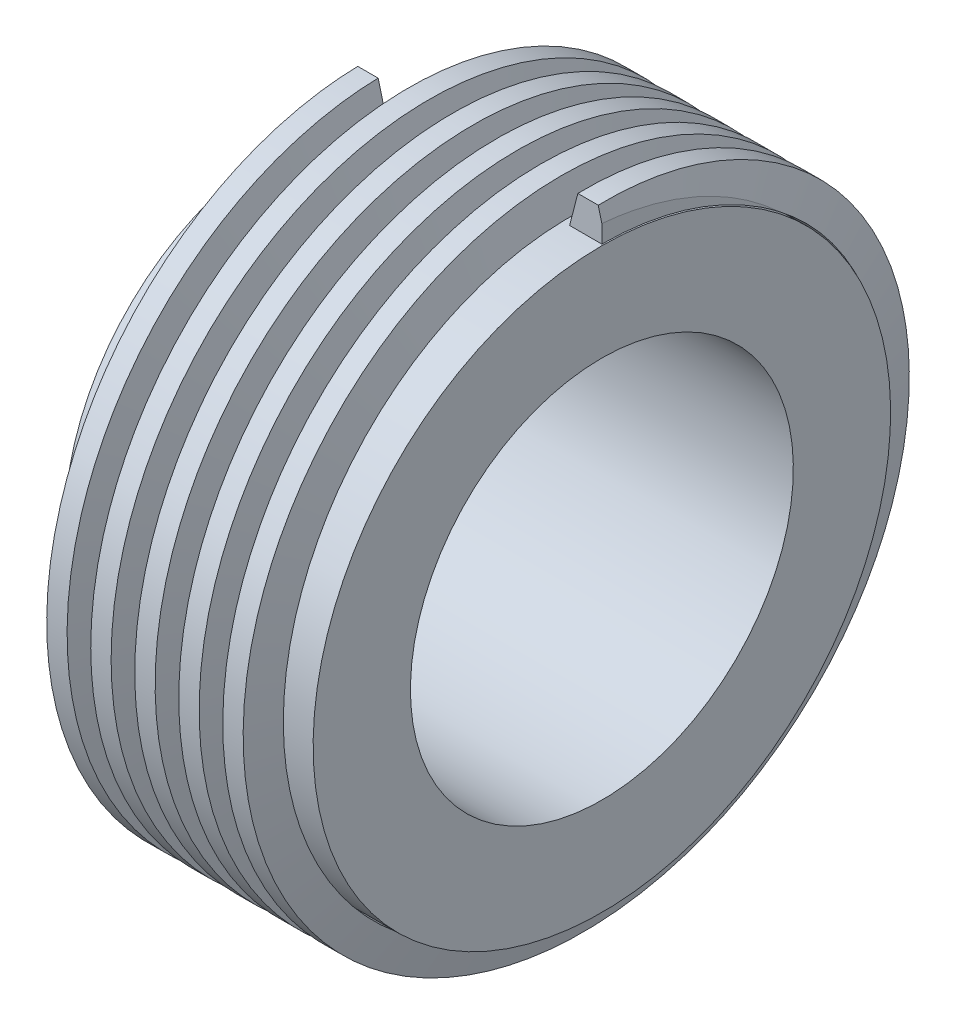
ISO-10303-21;
HEADER;
FILE_DESCRIPTION(('STEP AP214'),'2;1');
FILE_NAME('part.step','',(''),(''),'','','');
FILE_SCHEMA(('AUTOMOTIVE_DESIGN { 1 0 10303 214 1 1 1 1 }'));
ENDSEC;
DATA;
#1=APPLICATION_CONTEXT('core data for automotive mechanical design processes');
#2=APPLICATION_PROTOCOL_DEFINITION('international standard','automotive_design',2000,#1);
#3=PRODUCT_CONTEXT('',#1,'mechanical');
#4=PRODUCT('Part','Part','',(#3));
#5=PRODUCT_RELATED_PRODUCT_CATEGORY('part','',(#4));
#6=PRODUCT_DEFINITION_FORMATION('','',#4);
#7=PRODUCT_DEFINITION_CONTEXT('part definition',#1,'design');
#8=PRODUCT_DEFINITION('design','',#6,#7);
#9=PRODUCT_DEFINITION_SHAPE('','',#8);
#10=(LENGTH_UNIT() NAMED_UNIT(*) SI_UNIT(.MILLI.,.METRE.));
#11=(NAMED_UNIT(*) PLANE_ANGLE_UNIT() SI_UNIT($,.RADIAN.));
#12=(NAMED_UNIT(*) SI_UNIT($,.STERADIAN.) SOLID_ANGLE_UNIT());
#13=UNCERTAINTY_MEASURE_WITH_UNIT(LENGTH_MEASURE(1.E-05),#10,'distance_accuracy_value','');
#14=(GEOMETRIC_REPRESENTATION_CONTEXT(3) GLOBAL_UNCERTAINTY_ASSIGNED_CONTEXT((#13)) GLOBAL_UNIT_ASSIGNED_CONTEXT((#10,
#11,#12)) REPRESENTATION_CONTEXT('',''));
#15=CARTESIAN_POINT('',(0.,0.,0.));
#16=DIRECTION('',(0.,0.,1.));
#17=DIRECTION('',(1.,0.,0.));
#18=AXIS2_PLACEMENT_3D('',#15,#16,#17);
#19=CARTESIAN_POINT('',(18.3159324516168,17.6603714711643,-5.77099334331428E-05));
#20=DIRECTION('',(0.,3.26776441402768E-06,0.999999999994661));
#21=DIRECTION('',(0.,-0.999999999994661,3.26776441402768E-06));
#22=AXIS2_PLACEMENT_3D('',#19,#20,#21);
#23=PLANE('',#22);
#24=DIRECTION('',(1.,0.,0.));
#25=VECTOR('',#24,1.);
#26=CARTESIAN_POINT('',(17.4898003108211,16.7396214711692,-5.47011393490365E-05));
#27=LINE('',#26,#25);
#28=CARTESIAN_POINT('',(16.4255460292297,16.7396214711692,-5.47011393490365E-05));
#29=VERTEX_POINT('',#28);
#30=CARTESIAN_POINT('',(18.288,16.7396214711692,-5.47011393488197E-05));
#31=VERTEX_POINT('',#30);
#32=EDGE_CURVE('E110',#29,#31,#27,.T.);
#33=ORIENTED_EDGE('',*,*,#32,.T.);
#34=DIRECTION('',(0.,0.999999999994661,-3.26776441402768E-06));
#35=VECTOR('',#34,1.);
#36=CARTESIAN_POINT('',(18.288,17.6603714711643,-5.77099334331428E-05));
#37=LINE('',#36,#35);
#38=CARTESIAN_POINT('',(18.288,17.768378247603,-5.80628741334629E-05));
#39=VERTEX_POINT('',#38);
#40=EDGE_CURVE('E65',#31,#39,#37,.T.);
#41=ORIENTED_EDGE('',*,*,#40,.T.);
#42=DIRECTION('',(-0.250380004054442,0.968147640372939,-3.16367840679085E-06));
#43=VECTOR('',#42,1.);
#44=CARTESIAN_POINT('',(18.3159324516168,17.6603714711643,-5.77099334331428E-05));
#45=LINE('',#44,#43);
#46=CARTESIAN_POINT('',(18.0778103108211,18.5811214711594,-6.07187275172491E-05));
#47=VERTEX_POINT('',#46);
#48=EDGE_CURVE('E104',#39,#47,#45,.T.);
#49=ORIENTED_EDGE('',*,*,#48,.T.);
#50=DIRECTION('',(-1.,0.,0.));
#51=VECTOR('',#50,1.);
#52=CARTESIAN_POINT('',(17.4898003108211,18.5811214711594,-6.07187275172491E-05));
#53=LINE('',#52,#51);
#54=CARTESIAN_POINT('',(16.9017903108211,18.5811214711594,-6.07187275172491E-05));
#55=VERTEX_POINT('',#54);
#56=EDGE_CURVE('E136',#47,#55,#53,.T.);
#57=ORIENTED_EDGE('',*,*,#56,.T.);
#58=DIRECTION('',(-0.250380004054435,-0.968147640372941,3.16367840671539E-06));
#59=VECTOR('',#58,1.);
#60=CARTESIAN_POINT('',(16.6636681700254,17.6603714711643,-5.77099334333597E-05));
#61=LINE('',#60,#59);
#62=EDGE_CURVE('E131',#55,#29,#61,.T.);
#63=ORIENTED_EDGE('',*,*,#62,.T.);
#64=EDGE_LOOP('',(#33,#41,#49,#57,#63));
#65=FACE_BOUND('',#64,.T.);
#66=ADVANCED_FACE('F46',(#65),#23,.T.);
#67=CARTESIAN_POINT('',(18.5540545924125,16.7396214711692,-5.47011393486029E-05));
#68=CARTESIAN_POINT('',(18.4270545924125,16.7396036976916,-5.43908742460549));
#69=CARTESIAN_POINT('',(18.3000545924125,13.5426060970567,-9.83934688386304));
#70=CARTESIAN_POINT('',(18.1730545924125,10.3456084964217,-14.2396063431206));
#71=CARTESIAN_POINT('',(18.0460545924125,5.17277549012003,-15.9203429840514));
#72=CARTESIAN_POINT('',(17.9190545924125,-5.75161816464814E-05,-17.6010796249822));
#73=CARTESIAN_POINT('',(17.7920545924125,-5.17287953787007,-15.9203091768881));
#74=CARTESIAN_POINT('',(17.6650545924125,-10.3457015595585,-14.2395387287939));
#75=CARTESIAN_POINT('',(17.5380545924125,-13.5426704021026,-9.83925837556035));
#76=CARTESIAN_POINT('',(17.4110545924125,-16.7396392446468,-5.43897802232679));
#77=CARTESIAN_POINT('',(17.2840545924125,-16.7396214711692,5.47011393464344E-05));
#78=CARTESIAN_POINT('',(17.1570545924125,-16.7396036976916,5.43908742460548));
#79=CARTESIAN_POINT('',(17.0300545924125,-13.5426060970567,9.83934688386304));
#80=CARTESIAN_POINT('',(16.9030545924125,-10.3456084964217,14.2396063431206));
#81=CARTESIAN_POINT('',(16.7760545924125,-5.17277549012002,15.9203429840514));
#82=CARTESIAN_POINT('',(16.6490545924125,5.75161816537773E-05,17.6010796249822));
#83=CARTESIAN_POINT('',(16.5220545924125,5.17287953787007,15.9203091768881));
#84=CARTESIAN_POINT('',(16.3950545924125,10.3457015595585,14.2395387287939));
#85=CARTESIAN_POINT('',(16.2680545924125,13.5426704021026,9.83925837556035));
#86=CARTESIAN_POINT('',(16.1410545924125,16.7396392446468,5.43897802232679));
#87=CARTESIAN_POINT('',(16.0140545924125,16.7396214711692,-5.47011393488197E-05));
#88=CARTESIAN_POINT('',(15.8870545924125,16.7396036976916,-5.43908742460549));
#89=CARTESIAN_POINT('',(15.7600545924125,13.5426060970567,-9.83934688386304));
#90=CARTESIAN_POINT('',(15.6330545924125,10.3456084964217,-14.2396063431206));
#91=CARTESIAN_POINT('',(15.5060545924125,5.17277549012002,-15.9203429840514));
#92=CARTESIAN_POINT('',(15.3790545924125,-5.75161816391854E-05,-17.6010796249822));
#93=CARTESIAN_POINT('',(15.2520545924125,-5.17287953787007,-15.9203091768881));
#94=CARTESIAN_POINT('',(15.1250545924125,-10.3457015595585,-14.2395387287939));
#95=CARTESIAN_POINT('',(14.9980545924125,-13.5426704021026,-9.83925837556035));
#96=CARTESIAN_POINT('',(14.8710545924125,-16.7396392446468,-5.43897802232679));
#97=CARTESIAN_POINT('',(14.7440545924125,-16.7396214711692,5.47011393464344E-05));
#98=CARTESIAN_POINT('',(14.6170545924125,-16.7396036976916,5.43908742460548));
#99=CARTESIAN_POINT('',(14.4900545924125,-13.5426060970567,9.83934688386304));
#100=CARTESIAN_POINT('',(14.3630545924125,-10.3456084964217,14.2396063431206));
#101=CARTESIAN_POINT('',(14.2360545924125,-5.17277549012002,15.9203429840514));
#102=CARTESIAN_POINT('',(14.1090545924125,5.75161816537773E-05,17.6010796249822));
#103=CARTESIAN_POINT('',(13.9820545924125,5.17287953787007,15.9203091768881));
#104=CARTESIAN_POINT('',(13.8550545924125,10.3457015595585,14.2395387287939));
#105=CARTESIAN_POINT('',(13.7280545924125,13.5426704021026,9.83925837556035));
#106=CARTESIAN_POINT('',(13.6010545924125,16.7396392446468,5.43897802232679));
#107=CARTESIAN_POINT('',(13.4740545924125,16.7396214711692,-5.47011393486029E-05));
#108=CARTESIAN_POINT('',(13.3470545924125,16.7396036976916,-5.43908742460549));
#109=CARTESIAN_POINT('',(13.2200545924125,13.5426060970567,-9.83934688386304));
#110=CARTESIAN_POINT('',(13.0930545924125,10.3456084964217,-14.2396063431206));
#111=CARTESIAN_POINT('',(12.9660545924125,5.17277549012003,-15.9203429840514));
#112=CARTESIAN_POINT('',(12.8390545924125,-5.75161816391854E-05,-17.6010796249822));
#113=CARTESIAN_POINT('',(12.7120545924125,-5.17287953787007,-15.9203091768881));
#114=CARTESIAN_POINT('',(12.5850545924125,-10.3457015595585,-14.2395387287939));
#115=CARTESIAN_POINT('',(12.4580545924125,-13.5426704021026,-9.83925837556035));
#116=CARTESIAN_POINT('',(12.3310545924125,-16.7396392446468,-5.43897802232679));
#117=CARTESIAN_POINT('',(12.2040545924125,-16.7396214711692,5.47011393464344E-05));
#118=CARTESIAN_POINT('',(12.0770545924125,-16.7396036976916,5.43908742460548));
#119=CARTESIAN_POINT('',(11.9500545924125,-13.5426060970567,9.83934688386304));
#120=CARTESIAN_POINT('',(11.8230545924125,-10.3456084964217,14.2396063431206));
#121=CARTESIAN_POINT('',(11.6960545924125,-5.17277549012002,15.9203429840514));
#122=CARTESIAN_POINT('',(11.5690545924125,5.75161816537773E-05,17.6010796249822));
#123=CARTESIAN_POINT('',(11.4420545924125,5.17287953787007,15.9203091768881));
#124=CARTESIAN_POINT('',(11.3150545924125,10.3457015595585,14.2395387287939));
#125=CARTESIAN_POINT('',(11.1880545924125,13.5426704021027,9.83925837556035));
#126=CARTESIAN_POINT('',(11.0610545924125,16.7396392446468,5.43897802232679));
#127=CARTESIAN_POINT('',(10.9340545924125,16.7396214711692,-5.47011393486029E-05));
#128=CARTESIAN_POINT('',(10.8070545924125,16.7396036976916,-5.43908742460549));
#129=CARTESIAN_POINT('',(10.6800545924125,13.5426060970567,-9.83934688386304));
#130=CARTESIAN_POINT('',(10.5530545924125,10.3456084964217,-14.2396063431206));
#131=CARTESIAN_POINT('',(10.4260545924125,5.17277549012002,-15.9203429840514));
#132=CARTESIAN_POINT('',(10.2990545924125,-5.75161816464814E-05,-17.6010796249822));
#133=CARTESIAN_POINT('',(10.1720545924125,-5.17287953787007,-15.9203091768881));
#134=CARTESIAN_POINT('',(10.0450545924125,-10.3457015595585,-14.2395387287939));
#135=CARTESIAN_POINT('',(9.91805459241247,-13.5426704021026,-9.83925837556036));
#136=CARTESIAN_POINT('',(9.79105459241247,-16.7396392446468,-5.43897802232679));
#137=CARTESIAN_POINT('',(9.66405459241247,-16.7396214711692,5.47011393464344E-05));
#138=CARTESIAN_POINT('',(9.53705459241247,-16.7396036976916,5.43908742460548));
#139=CARTESIAN_POINT('',(9.41005459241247,-13.5426060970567,9.83934688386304));
#140=CARTESIAN_POINT('',(9.28305459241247,-10.3456084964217,14.2396063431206));
#141=CARTESIAN_POINT('',(9.15605459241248,-5.17277549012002,15.9203429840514));
#142=CARTESIAN_POINT('',(9.02905459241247,5.75161816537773E-05,17.6010796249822));
#143=CARTESIAN_POINT('',(8.90205459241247,5.17287953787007,15.9203091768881));
#144=CARTESIAN_POINT('',(8.77505459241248,10.3457015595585,14.2395387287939));
#145=CARTESIAN_POINT('',(8.64805459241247,13.5426704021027,9.83925837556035));
#146=CARTESIAN_POINT('',(8.52105459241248,16.7396392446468,5.43897802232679));
#147=CARTESIAN_POINT('',(8.39405459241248,16.7396214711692,-5.47011393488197E-05));
#148=CARTESIAN_POINT('',(8.26705459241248,16.7396036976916,-5.43908742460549));
#149=CARTESIAN_POINT('',(8.14005459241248,13.5426060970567,-9.83934688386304));
#150=CARTESIAN_POINT('',(8.01305459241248,10.3456084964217,-14.2396063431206));
#151=CARTESIAN_POINT('',(7.88605459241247,5.17277549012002,-15.9203429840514));
#152=CARTESIAN_POINT('',(7.75905459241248,-5.75161816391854E-05,-17.6010796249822));
#153=CARTESIAN_POINT('',(7.63205459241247,-5.17287953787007,-15.9203091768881));
#154=CARTESIAN_POINT('',(7.50505459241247,-10.3457015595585,-14.2395387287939));
#155=CARTESIAN_POINT('',(7.37805459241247,-13.5426704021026,-9.83925837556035));
#156=CARTESIAN_POINT('',(7.25105459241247,-16.7396392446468,-5.43897802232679));
#157=CARTESIAN_POINT('',(7.12405459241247,-16.7396214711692,5.47011393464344E-05));
#158=CARTESIAN_POINT('',(6.99705459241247,-16.7396036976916,5.43908742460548));
#159=CARTESIAN_POINT('',(6.87005459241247,-13.5426060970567,9.83934688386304));
#160=CARTESIAN_POINT('',(6.74305459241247,-10.3456084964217,14.2396063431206));
#161=CARTESIAN_POINT('',(6.61605459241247,-5.17277549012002,15.9203429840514));
#162=CARTESIAN_POINT('',(6.48905459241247,5.75161816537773E-05,17.6010796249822));
#163=CARTESIAN_POINT('',(6.36205459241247,5.17287953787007,15.9203091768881));
#164=CARTESIAN_POINT('',(6.23505459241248,10.3457015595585,14.2395387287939));
#165=CARTESIAN_POINT('',(6.10805459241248,13.5426704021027,9.83925837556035));
#166=CARTESIAN_POINT('',(5.98105459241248,16.7396392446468,5.43897802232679));
#167=CARTESIAN_POINT('',(5.85405459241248,16.7396214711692,-5.47011393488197E-05));
#168=CARTESIAN_POINT('',(18.0778103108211,18.5811214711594,-6.07187275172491E-05));
#169=CARTESIAN_POINT('',(17.9508103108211,18.5811017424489,-6.03743306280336));
#170=CARTESIAN_POINT('',(17.8238103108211,15.0324073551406,-10.9217582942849));
#171=CARTESIAN_POINT('',(17.6968103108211,11.4837129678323,-15.8060835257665));
#172=CARTESIAN_POINT('',(17.5698103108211,5.74182456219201,-17.6717154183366));
#173=CARTESIAN_POINT('',(17.4428103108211,-6.384344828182E-05,-19.5373473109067));
#174=CARTESIAN_POINT('',(17.3158103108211,-5.74194005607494,-17.6716778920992));
#175=CARTESIAN_POINT('',(17.1888103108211,-11.4838162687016,-15.8060084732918));
#176=CARTESIAN_POINT('',(17.0618103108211,-15.0324787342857,-10.9216600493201));
#177=CARTESIAN_POINT('',(16.9348103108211,-18.5811411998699,-6.03731162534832));
#178=CARTESIAN_POINT('',(16.8078103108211,-18.5811214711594,6.0718727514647E-05));
#179=CARTESIAN_POINT('',(16.6808103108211,-18.5811017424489,6.03743306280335));
#180=CARTESIAN_POINT('',(16.5538103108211,-15.0324073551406,10.9217582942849));
#181=CARTESIAN_POINT('',(16.4268103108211,-11.4837129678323,15.8060835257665));
#182=CARTESIAN_POINT('',(16.2998103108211,-5.74182456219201,17.6717154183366));
#183=CARTESIAN_POINT('',(16.1728103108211,6.3843448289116E-05,19.5373473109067));
#184=CARTESIAN_POINT('',(16.0458103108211,5.74194005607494,17.6716778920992));
#185=CARTESIAN_POINT('',(15.9188103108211,11.4838162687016,15.8060084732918));
#186=CARTESIAN_POINT('',(15.7918103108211,15.0324787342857,10.9216600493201));
#187=CARTESIAN_POINT('',(15.6648103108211,18.5811411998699,6.03731162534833));
#188=CARTESIAN_POINT('',(15.5378103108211,18.5811214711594,-6.07187275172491E-05));
#189=CARTESIAN_POINT('',(15.4108103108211,18.5811017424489,-6.03743306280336));
#190=CARTESIAN_POINT('',(15.2838103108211,15.0324073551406,-10.9217582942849));
#191=CARTESIAN_POINT('',(15.1568103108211,11.4837129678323,-15.8060835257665));
#192=CARTESIAN_POINT('',(15.0298103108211,5.74182456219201,-17.6717154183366));
#193=CARTESIAN_POINT('',(14.9028103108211,-6.384344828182E-05,-19.5373473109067));
#194=CARTESIAN_POINT('',(14.7758103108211,-5.74194005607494,-17.6716778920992));
#195=CARTESIAN_POINT('',(14.6488103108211,-11.4838162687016,-15.8060084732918));
#196=CARTESIAN_POINT('',(14.5218103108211,-15.0324787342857,-10.9216600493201));
#197=CARTESIAN_POINT('',(14.3948103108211,-18.5811411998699,-6.03731162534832));
#198=CARTESIAN_POINT('',(14.2678103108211,-18.5811214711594,6.0718727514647E-05));
#199=CARTESIAN_POINT('',(14.1408103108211,-18.5811017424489,6.03743306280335));
#200=CARTESIAN_POINT('',(14.0138103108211,-15.0324073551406,10.9217582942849));
#201=CARTESIAN_POINT('',(13.8868103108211,-11.4837129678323,15.8060835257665));
#202=CARTESIAN_POINT('',(13.7598103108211,-5.741824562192,17.6717154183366));
#203=CARTESIAN_POINT('',(13.6328103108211,6.384344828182E-05,19.5373473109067));
#204=CARTESIAN_POINT('',(13.5058103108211,5.74194005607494,17.6716778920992));
#205=CARTESIAN_POINT('',(13.3788103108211,11.4838162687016,15.8060084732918));
#206=CARTESIAN_POINT('',(13.2518103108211,15.0324787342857,10.9216600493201));
#207=CARTESIAN_POINT('',(13.1248103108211,18.5811411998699,6.03731162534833));
#208=CARTESIAN_POINT('',(12.9978103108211,18.5811214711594,-6.07187275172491E-05));
#209=CARTESIAN_POINT('',(12.8708103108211,18.5811017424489,-6.03743306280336));
#210=CARTESIAN_POINT('',(12.7438103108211,15.0324073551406,-10.9217582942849));
#211=CARTESIAN_POINT('',(12.6168103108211,11.4837129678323,-15.8060835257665));
#212=CARTESIAN_POINT('',(12.4898103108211,5.74182456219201,-17.6717154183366));
#213=CARTESIAN_POINT('',(12.3628103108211,-6.384344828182E-05,-19.5373473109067));
#214=CARTESIAN_POINT('',(12.2358103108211,-5.74194005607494,-17.6716778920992));
#215=CARTESIAN_POINT('',(12.1088103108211,-11.4838162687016,-15.8060084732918));
#216=CARTESIAN_POINT('',(11.9818103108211,-15.0324787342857,-10.9216600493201));
#217=CARTESIAN_POINT('',(11.8548103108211,-18.5811411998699,-6.03731162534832));
#218=CARTESIAN_POINT('',(11.7278103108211,-18.5811214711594,6.0718727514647E-05));
#219=CARTESIAN_POINT('',(11.6008103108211,-18.5811017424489,6.03743306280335));
#220=CARTESIAN_POINT('',(11.4738103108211,-15.0324073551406,10.9217582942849));
#221=CARTESIAN_POINT('',(11.3468103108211,-11.4837129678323,15.8060835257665));
#222=CARTESIAN_POINT('',(11.2198103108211,-5.74182456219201,17.6717154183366));
#223=CARTESIAN_POINT('',(11.0928103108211,6.3843448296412E-05,19.5373473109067));
#224=CARTESIAN_POINT('',(10.9658103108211,5.74194005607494,17.6716778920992));
#225=CARTESIAN_POINT('',(10.8388103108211,11.4838162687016,15.8060084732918));
#226=CARTESIAN_POINT('',(10.7118103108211,15.0324787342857,10.9216600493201));
#227=CARTESIAN_POINT('',(10.5848103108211,18.5811411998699,6.03731162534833));
#228=CARTESIAN_POINT('',(10.4578103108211,18.5811214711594,-6.07187275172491E-05));
#229=CARTESIAN_POINT('',(10.3308103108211,18.5811017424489,-6.03743306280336));
#230=CARTESIAN_POINT('',(10.2038103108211,15.0324073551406,-10.9217582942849));
#231=CARTESIAN_POINT('',(10.0768103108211,11.4837129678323,-15.8060835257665));
#232=CARTESIAN_POINT('',(9.9498103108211,5.74182456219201,-17.6717154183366));
#233=CARTESIAN_POINT('',(9.8228103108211,-6.384344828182E-05,-19.5373473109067));
#234=CARTESIAN_POINT('',(9.6958103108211,-5.74194005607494,-17.6716778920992));
#235=CARTESIAN_POINT('',(9.5688103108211,-11.4838162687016,-15.8060084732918));
#236=CARTESIAN_POINT('',(9.4418103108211,-15.0324787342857,-10.9216600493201));
#237=CARTESIAN_POINT('',(9.3148103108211,-18.5811411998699,-6.03731162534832));
#238=CARTESIAN_POINT('',(9.1878103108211,-18.5811214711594,6.0718727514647E-05));
#239=CARTESIAN_POINT('',(9.0608103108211,-18.5811017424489,6.03743306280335));
#240=CARTESIAN_POINT('',(8.9338103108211,-15.0324073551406,10.9217582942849));
#241=CARTESIAN_POINT('',(8.8068103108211,-11.4837129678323,15.8060835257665));
#242=CARTESIAN_POINT('',(8.6798103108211,-5.741824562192,17.6717154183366));
#243=CARTESIAN_POINT('',(8.5528103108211,6.3843448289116E-05,19.5373473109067));
#244=CARTESIAN_POINT('',(8.4258103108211,5.74194005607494,17.6716778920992));
#245=CARTESIAN_POINT('',(8.29881031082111,11.4838162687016,15.8060084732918));
#246=CARTESIAN_POINT('',(8.1718103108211,15.0324787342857,10.9216600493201));
#247=CARTESIAN_POINT('',(8.0448103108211,18.5811411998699,6.03731162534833));
#248=CARTESIAN_POINT('',(7.91781031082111,18.5811214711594,-6.07187275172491E-05));
#249=CARTESIAN_POINT('',(7.79081031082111,18.5811017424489,-6.03743306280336));
#250=CARTESIAN_POINT('',(7.6638103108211,15.0324073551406,-10.9217582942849));
#251=CARTESIAN_POINT('',(7.53681031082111,11.4837129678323,-15.8060835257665));
#252=CARTESIAN_POINT('',(7.4098103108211,5.74182456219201,-17.6717154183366));
#253=CARTESIAN_POINT('',(7.2828103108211,-6.38434482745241E-05,-19.5373473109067));
#254=CARTESIAN_POINT('',(7.1558103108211,-5.74194005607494,-17.6716778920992));
#255=CARTESIAN_POINT('',(7.0288103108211,-11.4838162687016,-15.8060084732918));
#256=CARTESIAN_POINT('',(6.9018103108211,-15.0324787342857,-10.9216600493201));
#257=CARTESIAN_POINT('',(6.7748103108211,-18.5811411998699,-6.03731162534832));
#258=CARTESIAN_POINT('',(6.6478103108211,-18.5811214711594,6.0718727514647E-05));
#259=CARTESIAN_POINT('',(6.5208103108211,-18.5811017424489,6.03743306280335));
#260=CARTESIAN_POINT('',(6.3938103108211,-15.0324073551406,10.9217582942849));
#261=CARTESIAN_POINT('',(6.2668103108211,-11.4837129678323,15.8060835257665));
#262=CARTESIAN_POINT('',(6.1398103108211,-5.741824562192,17.6717154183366));
#263=CARTESIAN_POINT('',(6.0128103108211,6.3843448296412E-05,19.5373473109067));
#264=CARTESIAN_POINT('',(5.8858103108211,5.74194005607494,17.6716778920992));
#265=CARTESIAN_POINT('',(5.7588103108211,11.4838162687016,15.8060084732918));
#266=CARTESIAN_POINT('',(5.6318103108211,15.0324787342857,10.9216600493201));
#267=CARTESIAN_POINT('',(5.50481031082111,18.5811411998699,6.03731162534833));
#268=CARTESIAN_POINT('',(5.37781031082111,18.5811214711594,-6.07187275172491E-05));
#269=(BOUNDED_SURFACE() B_SPLINE_SURFACE(1,2,((#67,#68,#69,#70,#71,#72,#73,#74,#75,#76,#77,#78,
#79,#80,#81,#82,#83,#84,#85,#86,#87,#88,#89,#90,#91,#92,#93,#94,#95,#96,#97,#98,#99,#100,#101,
#102,#103,#104,#105,#106,#107,#108,#109,#110,#111,#112,#113,#114,#115,#116,#117,#118,#119,#120,
#121,#122,#123,#124,#125,#126,#127,#128,#129,#130,#131,#132,#133,#134,#135,#136,#137,#138,#139,
#140,#141,#142,#143,#144,#145,#146,#147,#148,#149,#150,#151,#152,#153,#154,#155,#156,#157,#158,
#159,#160,#161,#162,#163,#164,#165,#166,#167),(#168,#169,#170,#171,#172,#173,#174,#175,#176,
#177,#178,#179,#180,#181,#182,#183,#184,#185,#186,#187,#188,#189,#190,#191,#192,#193,#194,#195,
#196,#197,#198,#199,#200,#201,#202,#203,#204,#205,#206,#207,#208,#209,#210,#211,#212,#213,#214,
#215,#216,#217,#218,#219,#220,#221,#222,#223,#224,#225,#226,#227,#228,#229,#230,#231,#232,#233,
#234,#235,#236,#237,#238,#239,#240,#241,#242,#243,#244,#245,#246,#247,#248,#249,#250,#251,#252,
#253,#254,#255,#256,#257,#258,#259,#260,#261,#262,#263,#264,#265,#266,#267,#268)),.UNSPECIFIED.,
.F.,.F.,.F.) B_SPLINE_SURFACE_WITH_KNOTS((2,2),(3,2,2,2,2,2,2,2,2,2,2,2,2,2,2,2,2,2,2,2,2,2,2,2,
2,2,2,2,2,2,2,2,2,2,2,2,2,2,2,2,2,2,2,2,2,2,2,2,2,2,3),(0.,1.),(0.,0.02,0.04,0.06,0.08,0.1,0.12,
0.14,0.16,0.18,0.2,0.22,0.24,0.26,0.28,0.3,0.32,0.34,0.36,0.38,0.4,0.42,0.44,0.46,0.48,0.5,0.52,
0.54,0.56,0.58,0.6,0.62,0.64,0.66,0.68,0.7,0.72,0.74,0.76,0.78,0.8,0.82,0.84,0.86,0.88,0.9,0.92,
0.94,0.96,0.98,1.),
.UNSPECIFIED.) GEOMETRIC_REPRESENTATION_ITEM() RATIONAL_B_SPLINE_SURFACE(((1.,0.951056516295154,
1.,0.951056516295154,1.,0.951056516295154,1.,0.951056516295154,1.,0.951056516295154,1.,
0.951056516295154,1.,0.951056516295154,1.,0.951056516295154,1.,0.951056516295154,1.,
0.951056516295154,1.,0.951056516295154,1.,0.951056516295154,1.,0.951056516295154,1.,
0.951056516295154,1.,0.951056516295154,1.,0.951056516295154,1.,0.951056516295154,1.,
0.951056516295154,1.,0.951056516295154,1.,0.951056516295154,1.,0.951056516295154,1.,
0.951056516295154,1.,0.951056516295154,1.,0.951056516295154,1.,0.951056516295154,1.,
0.951056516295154,1.,0.951056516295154,1.,0.951056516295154,1.,0.951056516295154,1.,
0.951056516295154,1.,0.951056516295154,1.,0.951056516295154,1.,0.951056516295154,1.,
0.951056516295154,1.,0.951056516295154,1.,0.951056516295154,1.,0.951056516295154,1.,
0.951056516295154,1.,0.951056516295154,1.,0.951056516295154,1.,0.951056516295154,1.,
0.951056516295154,1.,0.951056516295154,1.,0.951056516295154,1.,0.951056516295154,1.,
0.951056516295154,1.,0.951056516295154,1.,0.951056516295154,1.,0.951056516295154,1.,
0.951056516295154,1.),(1.,0.951056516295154,1.,0.951056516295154,1.,0.951056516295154,1.,
0.951056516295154,1.,0.951056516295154,1.,0.951056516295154,1.,0.951056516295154,1.,
0.951056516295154,1.,0.951056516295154,1.,0.951056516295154,1.,0.951056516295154,1.,
0.951056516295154,1.,0.951056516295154,1.,0.951056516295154,1.,0.951056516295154,1.,
0.951056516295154,1.,0.951056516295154,1.,0.951056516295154,1.,0.951056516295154,1.,
0.951056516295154,1.,0.951056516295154,1.,0.951056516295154,1.,0.951056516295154,1.,
0.951056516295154,1.,0.951056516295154,1.,0.951056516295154,1.,0.951056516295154,1.,
0.951056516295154,1.,0.951056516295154,1.,0.951056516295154,1.,0.951056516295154,1.,
0.951056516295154,1.,0.951056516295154,1.,0.951056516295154,1.,0.951056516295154,1.,
0.951056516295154,1.,0.951056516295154,1.,0.951056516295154,1.,0.951056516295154,1.,
0.951056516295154,1.,0.951056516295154,1.,0.951056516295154,1.,0.951056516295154,1.,
0.951056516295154,1.,0.951056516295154,1.,0.951056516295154,1.,0.951056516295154,1.,
0.951056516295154,1.,0.951056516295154,1.,0.951056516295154,1.))) REPRESENTATION_ITEM('') SURFACE());
#270=CARTESIAN_POINT('',(18.288,13.2342807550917,-10.2503043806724));
#271=CARTESIAN_POINT('',(18.288,13.3485090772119,-10.1277353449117));
#272=CARTESIAN_POINT('',(18.288,13.4607527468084,-10.0033368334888));
#273=CARTESIAN_POINT('',(18.288,13.6262681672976,-9.81426204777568));
#274=CARTESIAN_POINT('',(18.288,13.6809614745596,-9.75082851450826));
#275=CARTESIAN_POINT('',(18.288,13.7894234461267,-9.62317592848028));
#276=CARTESIAN_POINT('',(18.288,13.8431921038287,-9.55895687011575));
#277=CARTESIAN_POINT('',(18.288,14.0030612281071,-9.36515508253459));
#278=CARTESIAN_POINT('',(18.288,14.1077485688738,-9.23440063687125));
#279=CARTESIAN_POINT('',(18.288,14.3132735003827,-8.9698806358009));
#280=CARTESIAN_POINT('',(18.288,14.4141105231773,-8.8361146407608));
#281=CARTESIAN_POINT('',(18.288,14.7112073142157,-8.42978445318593));
#282=CARTESIAN_POINT('',(18.288,14.9015225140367,-8.15283084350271));
#283=CARTESIAN_POINT('',(18.288,15.2656074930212,-7.58827716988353));
#284=CARTESIAN_POINT('',(18.288,15.4393761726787,-7.30067640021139));
#285=CARTESIAN_POINT('',(18.288,15.8426448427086,-6.58679083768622));
#286=CARTESIAN_POINT('',(18.288,16.0629437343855,-6.15526029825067));
#287=CARTESIAN_POINT('',(18.288,16.4664251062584,-5.27504838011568));
#288=CARTESIAN_POINT('',(18.288,16.6495950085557,-4.82636125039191));
#289=CARTESIAN_POINT('',(18.288,16.9772275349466,-3.9157842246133));
#290=CARTESIAN_POINT('',(18.288,17.1217439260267,-3.45391366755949));
#291=CARTESIAN_POINT('',(18.288,17.3713258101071,-2.51985912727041));
#292=CARTESIAN_POINT('',(18.288,17.4764135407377,-2.04768111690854));
#293=CARTESIAN_POINT('',(18.288,17.6080189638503,-1.31158609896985));
#294=CARTESIAN_POINT('',(18.288,17.6485729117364,-1.05010333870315));
#295=CARTESIAN_POINT('',(18.288,17.7175488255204,-0.52594681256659));
#296=CARTESIAN_POINT('',(18.288,17.7459891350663,-0.263275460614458));
#297=CARTESIAN_POINT('',(18.288,17.768378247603,-5.80628741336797E-05));
#298=B_SPLINE_CURVE_WITH_KNOTS('',3,(#270,#271,#272,#273,#274,#275,#276,#277,#278,#279,#280,
#281,#282,#283,#284,#285,#286,#287,#288,#289,#290,#291,#292,#293,#294,#295,#296,#297),
.UNSPECIFIED.,.F.,.F.,(4,2,2,2,2,2,2,2,2,2,2,2,2,4),(0.,0.502587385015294,0.753848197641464,
1.00511080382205,1.50752799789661,2.01001901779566,3.0174971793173,4.02504224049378,
5.47674830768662,6.92894533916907,8.37911173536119,9.82845900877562,10.6220365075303,
11.4144079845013),.UNSPECIFIED.);
#299=CARTESIAN_POINT('',(18.288,13.2342807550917,-10.2503043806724));
#300=VERTEX_POINT('',#299);
#301=EDGE_CURVE('E97',#300,#39,#298,.T.);
#302=CARTESIAN_POINT('',(18.5540545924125,16.7396214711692,-5.47011393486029E-05));
#303=CARTESIAN_POINT('',(18.4270545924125,16.7396036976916,-5.43908742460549));
#304=CARTESIAN_POINT('',(18.3000545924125,13.5426060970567,-9.83934688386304));
#305=CARTESIAN_POINT('',(18.1730545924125,10.3456084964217,-14.2396063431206));
#306=CARTESIAN_POINT('',(18.0460545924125,5.17277549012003,-15.9203429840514));
#307=CARTESIAN_POINT('',(17.9190545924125,-5.75161816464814E-05,-17.6010796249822));
#308=CARTESIAN_POINT('',(17.7920545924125,-5.17287953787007,-15.9203091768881));
#309=CARTESIAN_POINT('',(17.6650545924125,-10.3457015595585,-14.2395387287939));
#310=CARTESIAN_POINT('',(17.5380545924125,-13.5426704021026,-9.83925837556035));
#311=CARTESIAN_POINT('',(17.4110545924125,-16.7396392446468,-5.43897802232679));
#312=CARTESIAN_POINT('',(17.2840545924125,-16.7396214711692,5.47011393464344E-05));
#313=CARTESIAN_POINT('',(17.1570545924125,-16.7396036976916,5.43908742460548));
#314=CARTESIAN_POINT('',(17.0300545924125,-13.5426060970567,9.83934688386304));
#315=CARTESIAN_POINT('',(16.9030545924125,-10.3456084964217,14.2396063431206));
#316=CARTESIAN_POINT('',(16.7760545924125,-5.17277549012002,15.9203429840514));
#317=CARTESIAN_POINT('',(16.6490545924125,5.75161816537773E-05,17.6010796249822));
#318=CARTESIAN_POINT('',(16.5220545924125,5.17287953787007,15.9203091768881));
#319=CARTESIAN_POINT('',(16.3950545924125,10.3457015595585,14.2395387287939));
#320=CARTESIAN_POINT('',(16.2680545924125,13.5426704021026,9.83925837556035));
#321=CARTESIAN_POINT('',(16.1410545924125,16.7396392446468,5.43897802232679));
#322=CARTESIAN_POINT('',(16.0140545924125,16.7396214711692,-5.47011393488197E-05));
#323=CARTESIAN_POINT('',(15.8870545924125,16.7396036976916,-5.43908742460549));
#324=CARTESIAN_POINT('',(15.7600545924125,13.5426060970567,-9.83934688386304));
#325=CARTESIAN_POINT('',(15.6330545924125,10.3456084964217,-14.2396063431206));
#326=CARTESIAN_POINT('',(15.5060545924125,5.17277549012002,-15.9203429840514));
#327=CARTESIAN_POINT('',(15.3790545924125,-5.75161816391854E-05,-17.6010796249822));
#328=CARTESIAN_POINT('',(15.2520545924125,-5.17287953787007,-15.9203091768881));
#329=CARTESIAN_POINT('',(15.1250545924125,-10.3457015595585,-14.2395387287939));
#330=CARTESIAN_POINT('',(14.9980545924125,-13.5426704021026,-9.83925837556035));
#331=CARTESIAN_POINT('',(14.8710545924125,-16.7396392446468,-5.43897802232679));
#332=CARTESIAN_POINT('',(14.7440545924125,-16.7396214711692,5.47011393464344E-05));
#333=CARTESIAN_POINT('',(14.6170545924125,-16.7396036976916,5.43908742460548));
#334=CARTESIAN_POINT('',(14.4900545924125,-13.5426060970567,9.83934688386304));
#335=CARTESIAN_POINT('',(14.3630545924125,-10.3456084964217,14.2396063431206));
#336=CARTESIAN_POINT('',(14.2360545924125,-5.17277549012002,15.9203429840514));
#337=CARTESIAN_POINT('',(14.1090545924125,5.75161816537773E-05,17.6010796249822));
#338=CARTESIAN_POINT('',(13.9820545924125,5.17287953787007,15.9203091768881));
#339=CARTESIAN_POINT('',(13.8550545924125,10.3457015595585,14.2395387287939));
#340=CARTESIAN_POINT('',(13.7280545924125,13.5426704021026,9.83925837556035));
#341=CARTESIAN_POINT('',(13.6010545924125,16.7396392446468,5.43897802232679));
#342=CARTESIAN_POINT('',(13.4740545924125,16.7396214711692,-5.47011393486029E-05));
#343=CARTESIAN_POINT('',(13.3470545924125,16.7396036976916,-5.43908742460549));
#344=CARTESIAN_POINT('',(13.2200545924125,13.5426060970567,-9.83934688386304));
#345=CARTESIAN_POINT('',(13.0930545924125,10.3456084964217,-14.2396063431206));
#346=CARTESIAN_POINT('',(12.9660545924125,5.17277549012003,-15.9203429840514));
#347=CARTESIAN_POINT('',(12.8390545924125,-5.75161816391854E-05,-17.6010796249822));
#348=CARTESIAN_POINT('',(12.7120545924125,-5.17287953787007,-15.9203091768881));
#349=CARTESIAN_POINT('',(12.5850545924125,-10.3457015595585,-14.2395387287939));
#350=CARTESIAN_POINT('',(12.4580545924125,-13.5426704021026,-9.83925837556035));
#351=CARTESIAN_POINT('',(12.3310545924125,-16.7396392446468,-5.43897802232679));
#352=CARTESIAN_POINT('',(12.2040545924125,-16.7396214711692,5.47011393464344E-05));
#353=CARTESIAN_POINT('',(12.0770545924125,-16.7396036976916,5.43908742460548));
#354=CARTESIAN_POINT('',(11.9500545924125,-13.5426060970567,9.83934688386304));
#355=CARTESIAN_POINT('',(11.8230545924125,-10.3456084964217,14.2396063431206));
#356=CARTESIAN_POINT('',(11.6960545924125,-5.17277549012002,15.9203429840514));
#357=CARTESIAN_POINT('',(11.5690545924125,5.75161816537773E-05,17.6010796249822));
#358=CARTESIAN_POINT('',(11.4420545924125,5.17287953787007,15.9203091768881));
#359=CARTESIAN_POINT('',(11.3150545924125,10.3457015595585,14.2395387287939));
#360=CARTESIAN_POINT('',(11.1880545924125,13.5426704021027,9.83925837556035));
#361=CARTESIAN_POINT('',(11.0610545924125,16.7396392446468,5.43897802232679));
#362=CARTESIAN_POINT('',(10.9340545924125,16.7396214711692,-5.47011393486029E-05));
#363=CARTESIAN_POINT('',(10.8070545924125,16.7396036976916,-5.43908742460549));
#364=CARTESIAN_POINT('',(10.6800545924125,13.5426060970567,-9.83934688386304));
#365=CARTESIAN_POINT('',(10.5530545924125,10.3456084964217,-14.2396063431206));
#366=CARTESIAN_POINT('',(10.4260545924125,5.17277549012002,-15.9203429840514));
#367=CARTESIAN_POINT('',(10.2990545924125,-5.75161816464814E-05,-17.6010796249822));
#368=CARTESIAN_POINT('',(10.1720545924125,-5.17287953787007,-15.9203091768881));
#369=CARTESIAN_POINT('',(10.0450545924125,-10.3457015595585,-14.2395387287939));
#370=CARTESIAN_POINT('',(9.91805459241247,-13.5426704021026,-9.83925837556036));
#371=CARTESIAN_POINT('',(9.79105459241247,-16.7396392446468,-5.43897802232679));
#372=CARTESIAN_POINT('',(9.66405459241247,-16.7396214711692,5.47011393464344E-05));
#373=CARTESIAN_POINT('',(9.53705459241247,-16.7396036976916,5.43908742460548));
#374=CARTESIAN_POINT('',(9.41005459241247,-13.5426060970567,9.83934688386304));
#375=CARTESIAN_POINT('',(9.28305459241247,-10.3456084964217,14.2396063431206));
#376=CARTESIAN_POINT('',(9.15605459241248,-5.17277549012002,15.9203429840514));
#377=CARTESIAN_POINT('',(9.02905459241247,5.75161816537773E-05,17.6010796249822));
#378=CARTESIAN_POINT('',(8.90205459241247,5.17287953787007,15.9203091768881));
#379=CARTESIAN_POINT('',(8.77505459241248,10.3457015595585,14.2395387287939));
#380=CARTESIAN_POINT('',(8.64805459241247,13.5426704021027,9.83925837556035));
#381=CARTESIAN_POINT('',(8.52105459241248,16.7396392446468,5.43897802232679));
#382=CARTESIAN_POINT('',(8.39405459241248,16.7396214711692,-5.47011393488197E-05));
#383=CARTESIAN_POINT('',(8.26705459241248,16.7396036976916,-5.43908742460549));
#384=CARTESIAN_POINT('',(8.14005459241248,13.5426060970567,-9.83934688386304));
#385=CARTESIAN_POINT('',(8.01305459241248,10.3456084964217,-14.2396063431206));
#386=CARTESIAN_POINT('',(7.88605459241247,5.17277549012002,-15.9203429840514));
#387=CARTESIAN_POINT('',(7.75905459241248,-5.75161816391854E-05,-17.6010796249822));
#388=CARTESIAN_POINT('',(7.63205459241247,-5.17287953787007,-15.9203091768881));
#389=CARTESIAN_POINT('',(7.50505459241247,-10.3457015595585,-14.2395387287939));
#390=CARTESIAN_POINT('',(7.37805459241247,-13.5426704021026,-9.83925837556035));
#391=CARTESIAN_POINT('',(7.25105459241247,-16.7396392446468,-5.43897802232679));
#392=CARTESIAN_POINT('',(7.12405459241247,-16.7396214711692,5.47011393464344E-05));
#393=CARTESIAN_POINT('',(6.99705459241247,-16.7396036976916,5.43908742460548));
#394=CARTESIAN_POINT('',(6.87005459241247,-13.5426060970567,9.83934688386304));
#395=CARTESIAN_POINT('',(6.74305459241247,-10.3456084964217,14.2396063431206));
#396=CARTESIAN_POINT('',(6.61605459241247,-5.17277549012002,15.9203429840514));
#397=CARTESIAN_POINT('',(6.48905459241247,5.75161816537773E-05,17.6010796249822));
#398=CARTESIAN_POINT('',(6.36205459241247,5.17287953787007,15.9203091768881));
#399=CARTESIAN_POINT('',(6.23505459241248,10.3457015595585,14.2395387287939));
#400=CARTESIAN_POINT('',(6.10805459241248,13.5426704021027,9.83925837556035));
#401=CARTESIAN_POINT('',(5.98105459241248,16.7396392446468,5.43897802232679));
#402=CARTESIAN_POINT('',(5.85405459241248,16.7396214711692,-5.47011393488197E-05));
#403=(BOUNDED_CURVE() B_SPLINE_CURVE(2,(#302,#303,#304,#305,#306,#307,#308,#309,#310,#311,#312,
#313,#314,#315,#316,#317,#318,#319,#320,#321,#322,#323,#324,#325,#326,#327,#328,#329,#330,#331,
#332,#333,#334,#335,#336,#337,#338,#339,#340,#341,#342,#343,#344,#345,#346,#347,#348,#349,#350,
#351,#352,#353,#354,#355,#356,#357,#358,#359,#360,#361,#362,#363,#364,#365,#366,#367,#368,#369,
#370,#371,#372,#373,#374,#375,#376,#377,#378,#379,#380,#381,#382,#383,#384,#385,#386,#387,#388,
#389,#390,#391,#392,#393,#394,#395,#396,#397,#398,#399,#400,#401,#402),.UNSPECIFIED.,.F.,
.F.) B_SPLINE_CURVE_WITH_KNOTS((3,2,2,2,2,2,2,2,2,2,2,2,2,2,2,2,2,2,2,2,2,2,2,2,2,2,2,2,2,2,2,2,
2,2,2,2,2,2,2,2,2,2,2,2,2,2,2,2,2,2,3),(0.,0.02,0.04,0.06,0.08,0.1,0.12,0.14,0.16,0.18,0.2,0.22,
0.24,0.26,0.28,0.3,0.32,0.34,0.36,0.38,0.4,0.42,0.44,0.46,0.48,0.5,0.52,0.54,0.56,0.58,0.6,0.62,
0.64,0.66,0.68,0.7,0.72,0.74,0.76,0.78,0.8,0.82,0.84,0.86,0.88,0.9,0.92,0.94,0.96,0.98,1.),
.UNSPECIFIED.) CURVE() GEOMETRIC_REPRESENTATION_ITEM() RATIONAL_B_SPLINE_CURVE((1.,
0.951056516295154,1.,0.951056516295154,1.,0.951056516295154,1.,0.951056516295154,1.,
0.951056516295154,1.,0.951056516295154,1.,0.951056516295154,1.,0.951056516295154,1.,
0.951056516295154,1.,0.951056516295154,1.,0.951056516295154,1.,0.951056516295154,1.,
0.951056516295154,1.,0.951056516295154,1.,0.951056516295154,1.,0.951056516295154,1.,
0.951056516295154,1.,0.951056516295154,1.,0.951056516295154,1.,0.951056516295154,1.,
0.951056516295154,1.,0.951056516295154,1.,0.951056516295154,1.,0.951056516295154,1.,
0.951056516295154,1.,0.951056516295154,1.,0.951056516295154,1.,0.951056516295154,1.,
0.951056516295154,1.,0.951056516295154,1.,0.951056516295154,1.,0.951056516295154,1.,
0.951056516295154,1.,0.951056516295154,1.,0.951056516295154,1.,0.951056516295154,1.,
0.951056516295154,1.,0.951056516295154,1.,0.951056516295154,1.,0.951056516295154,1.,
0.951056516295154,1.,0.951056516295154,1.,0.951056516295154,1.,0.951056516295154,1.,
0.951056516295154,1.,0.951056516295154,1.,0.951056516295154,1.,0.951056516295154,1.,
0.951056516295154,1.,0.951056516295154,1.)) REPRESENTATION_ITEM(''));
#404=CARTESIAN_POINT('',(5.85405459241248,16.7396214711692,-5.47011393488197E-05));
#405=VERTEX_POINT('',#404);
#406=EDGE_CURVE('E73',#300,#405,#403,.T.);
#407=DIRECTION('',(0.250380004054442,-0.968147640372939,3.16367840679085E-06));
#408=VECTOR('',#407,1.);
#409=CARTESIAN_POINT('',(5.61593245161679,17.6603714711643,-5.77099334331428E-05));
#410=LINE('',#409,#408);
#411=CARTESIAN_POINT('',(5.37781031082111,18.5811214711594,-6.07187275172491E-05));
#412=VERTEX_POINT('',#411);
#413=EDGE_CURVE('E59',#412,#405,#410,.T.);
#414=CARTESIAN_POINT('',(18.0778103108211,18.5811214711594,-6.07187275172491E-05));
#415=CARTESIAN_POINT('',(17.9508103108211,18.5811017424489,-6.03743306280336));
#416=CARTESIAN_POINT('',(17.8238103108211,15.0324073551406,-10.9217582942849));
#417=CARTESIAN_POINT('',(17.6968103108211,11.4837129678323,-15.8060835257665));
#418=CARTESIAN_POINT('',(17.5698103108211,5.74182456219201,-17.6717154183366));
#419=CARTESIAN_POINT('',(17.4428103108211,-6.384344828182E-05,-19.5373473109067));
#420=CARTESIAN_POINT('',(17.3158103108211,-5.74194005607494,-17.6716778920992));
#421=CARTESIAN_POINT('',(17.1888103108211,-11.4838162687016,-15.8060084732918));
#422=CARTESIAN_POINT('',(17.0618103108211,-15.0324787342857,-10.9216600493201));
#423=CARTESIAN_POINT('',(16.9348103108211,-18.5811411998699,-6.03731162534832));
#424=CARTESIAN_POINT('',(16.8078103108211,-18.5811214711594,6.0718727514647E-05));
#425=CARTESIAN_POINT('',(16.6808103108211,-18.5811017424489,6.03743306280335));
#426=CARTESIAN_POINT('',(16.5538103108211,-15.0324073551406,10.9217582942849));
#427=CARTESIAN_POINT('',(16.4268103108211,-11.4837129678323,15.8060835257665));
#428=CARTESIAN_POINT('',(16.2998103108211,-5.74182456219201,17.6717154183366));
#429=CARTESIAN_POINT('',(16.1728103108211,6.3843448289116E-05,19.5373473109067));
#430=CARTESIAN_POINT('',(16.0458103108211,5.74194005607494,17.6716778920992));
#431=CARTESIAN_POINT('',(15.9188103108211,11.4838162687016,15.8060084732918));
#432=CARTESIAN_POINT('',(15.7918103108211,15.0324787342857,10.9216600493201));
#433=CARTESIAN_POINT('',(15.6648103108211,18.5811411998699,6.03731162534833));
#434=CARTESIAN_POINT('',(15.5378103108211,18.5811214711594,-6.07187275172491E-05));
#435=CARTESIAN_POINT('',(15.4108103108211,18.5811017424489,-6.03743306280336));
#436=CARTESIAN_POINT('',(15.2838103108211,15.0324073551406,-10.9217582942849));
#437=CARTESIAN_POINT('',(15.1568103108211,11.4837129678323,-15.8060835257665));
#438=CARTESIAN_POINT('',(15.0298103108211,5.74182456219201,-17.6717154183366));
#439=CARTESIAN_POINT('',(14.9028103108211,-6.384344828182E-05,-19.5373473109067));
#440=CARTESIAN_POINT('',(14.7758103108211,-5.74194005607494,-17.6716778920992));
#441=CARTESIAN_POINT('',(14.6488103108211,-11.4838162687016,-15.8060084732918));
#442=CARTESIAN_POINT('',(14.5218103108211,-15.0324787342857,-10.9216600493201));
#443=CARTESIAN_POINT('',(14.3948103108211,-18.5811411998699,-6.03731162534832));
#444=CARTESIAN_POINT('',(14.2678103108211,-18.5811214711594,6.0718727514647E-05));
#445=CARTESIAN_POINT('',(14.1408103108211,-18.5811017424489,6.03743306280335));
#446=CARTESIAN_POINT('',(14.0138103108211,-15.0324073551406,10.9217582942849));
#447=CARTESIAN_POINT('',(13.8868103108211,-11.4837129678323,15.8060835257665));
#448=CARTESIAN_POINT('',(13.7598103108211,-5.741824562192,17.6717154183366));
#449=CARTESIAN_POINT('',(13.6328103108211,6.384344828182E-05,19.5373473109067));
#450=CARTESIAN_POINT('',(13.5058103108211,5.74194005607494,17.6716778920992));
#451=CARTESIAN_POINT('',(13.3788103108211,11.4838162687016,15.8060084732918));
#452=CARTESIAN_POINT('',(13.2518103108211,15.0324787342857,10.9216600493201));
#453=CARTESIAN_POINT('',(13.1248103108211,18.5811411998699,6.03731162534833));
#454=CARTESIAN_POINT('',(12.9978103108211,18.5811214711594,-6.07187275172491E-05));
#455=CARTESIAN_POINT('',(12.8708103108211,18.5811017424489,-6.03743306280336));
#456=CARTESIAN_POINT('',(12.7438103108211,15.0324073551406,-10.9217582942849));
#457=CARTESIAN_POINT('',(12.6168103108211,11.4837129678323,-15.8060835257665));
#458=CARTESIAN_POINT('',(12.4898103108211,5.74182456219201,-17.6717154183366));
#459=CARTESIAN_POINT('',(12.3628103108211,-6.384344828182E-05,-19.5373473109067));
#460=CARTESIAN_POINT('',(12.2358103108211,-5.74194005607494,-17.6716778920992));
#461=CARTESIAN_POINT('',(12.1088103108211,-11.4838162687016,-15.8060084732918));
#462=CARTESIAN_POINT('',(11.9818103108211,-15.0324787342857,-10.9216600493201));
#463=CARTESIAN_POINT('',(11.8548103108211,-18.5811411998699,-6.03731162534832));
#464=CARTESIAN_POINT('',(11.7278103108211,-18.5811214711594,6.0718727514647E-05));
#465=CARTESIAN_POINT('',(11.6008103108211,-18.5811017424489,6.03743306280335));
#466=CARTESIAN_POINT('',(11.4738103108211,-15.0324073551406,10.9217582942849));
#467=CARTESIAN_POINT('',(11.3468103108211,-11.4837129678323,15.8060835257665));
#468=CARTESIAN_POINT('',(11.2198103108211,-5.74182456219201,17.6717154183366));
#469=CARTESIAN_POINT('',(11.0928103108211,6.3843448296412E-05,19.5373473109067));
#470=CARTESIAN_POINT('',(10.9658103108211,5.74194005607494,17.6716778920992));
#471=CARTESIAN_POINT('',(10.8388103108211,11.4838162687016,15.8060084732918));
#472=CARTESIAN_POINT('',(10.7118103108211,15.0324787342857,10.9216600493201));
#473=CARTESIAN_POINT('',(10.5848103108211,18.5811411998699,6.03731162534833));
#474=CARTESIAN_POINT('',(10.4578103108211,18.5811214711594,-6.07187275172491E-05));
#475=CARTESIAN_POINT('',(10.3308103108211,18.5811017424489,-6.03743306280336));
#476=CARTESIAN_POINT('',(10.2038103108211,15.0324073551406,-10.9217582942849));
#477=CARTESIAN_POINT('',(10.0768103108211,11.4837129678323,-15.8060835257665));
#478=CARTESIAN_POINT('',(9.9498103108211,5.74182456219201,-17.6717154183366));
#479=CARTESIAN_POINT('',(9.8228103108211,-6.384344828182E-05,-19.5373473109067));
#480=CARTESIAN_POINT('',(9.6958103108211,-5.74194005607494,-17.6716778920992));
#481=CARTESIAN_POINT('',(9.5688103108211,-11.4838162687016,-15.8060084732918));
#482=CARTESIAN_POINT('',(9.4418103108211,-15.0324787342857,-10.9216600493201));
#483=CARTESIAN_POINT('',(9.3148103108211,-18.5811411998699,-6.03731162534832));
#484=CARTESIAN_POINT('',(9.1878103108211,-18.5811214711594,6.0718727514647E-05));
#485=CARTESIAN_POINT('',(9.0608103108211,-18.5811017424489,6.03743306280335));
#486=CARTESIAN_POINT('',(8.9338103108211,-15.0324073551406,10.9217582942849));
#487=CARTESIAN_POINT('',(8.8068103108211,-11.4837129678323,15.8060835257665));
#488=CARTESIAN_POINT('',(8.6798103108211,-5.741824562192,17.6717154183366));
#489=CARTESIAN_POINT('',(8.5528103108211,6.3843448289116E-05,19.5373473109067));
#490=CARTESIAN_POINT('',(8.4258103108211,5.74194005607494,17.6716778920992));
#491=CARTESIAN_POINT('',(8.29881031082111,11.4838162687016,15.8060084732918));
#492=CARTESIAN_POINT('',(8.1718103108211,15.0324787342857,10.9216600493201));
#493=CARTESIAN_POINT('',(8.0448103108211,18.5811411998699,6.03731162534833));
#494=CARTESIAN_POINT('',(7.91781031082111,18.5811214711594,-6.07187275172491E-05));
#495=CARTESIAN_POINT('',(7.79081031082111,18.5811017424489,-6.03743306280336));
#496=CARTESIAN_POINT('',(7.6638103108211,15.0324073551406,-10.9217582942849));
#497=CARTESIAN_POINT('',(7.53681031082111,11.4837129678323,-15.8060835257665));
#498=CARTESIAN_POINT('',(7.4098103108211,5.74182456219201,-17.6717154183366));
#499=CARTESIAN_POINT('',(7.2828103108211,-6.38434482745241E-05,-19.5373473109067));
#500=CARTESIAN_POINT('',(7.1558103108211,-5.74194005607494,-17.6716778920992));
#501=CARTESIAN_POINT('',(7.0288103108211,-11.4838162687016,-15.8060084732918));
#502=CARTESIAN_POINT('',(6.9018103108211,-15.0324787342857,-10.9216600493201));
#503=CARTESIAN_POINT('',(6.7748103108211,-18.5811411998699,-6.03731162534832));
#504=CARTESIAN_POINT('',(6.6478103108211,-18.5811214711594,6.0718727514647E-05));
#505=CARTESIAN_POINT('',(6.5208103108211,-18.5811017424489,6.03743306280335));
#506=CARTESIAN_POINT('',(6.3938103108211,-15.0324073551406,10.9217582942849));
#507=CARTESIAN_POINT('',(6.2668103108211,-11.4837129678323,15.8060835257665));
#508=CARTESIAN_POINT('',(6.1398103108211,-5.741824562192,17.6717154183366));
#509=CARTESIAN_POINT('',(6.0128103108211,6.3843448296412E-05,19.5373473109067));
#510=CARTESIAN_POINT('',(5.8858103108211,5.74194005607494,17.6716778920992));
#511=CARTESIAN_POINT('',(5.7588103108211,11.4838162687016,15.8060084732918));
#512=CARTESIAN_POINT('',(5.6318103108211,15.0324787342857,10.9216600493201));
#513=CARTESIAN_POINT('',(5.50481031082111,18.5811411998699,6.03731162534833));
#514=CARTESIAN_POINT('',(5.37781031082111,18.5811214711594,-6.07187275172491E-05));
#515=(BOUNDED_CURVE() B_SPLINE_CURVE(2,(#414,#415,#416,#417,#418,#419,#420,#421,#422,#423,#424,
#425,#426,#427,#428,#429,#430,#431,#432,#433,#434,#435,#436,#437,#438,#439,#440,#441,#442,#443,
#444,#445,#446,#447,#448,#449,#450,#451,#452,#453,#454,#455,#456,#457,#458,#459,#460,#461,#462,
#463,#464,#465,#466,#467,#468,#469,#470,#471,#472,#473,#474,#475,#476,#477,#478,#479,#480,#481,
#482,#483,#484,#485,#486,#487,#488,#489,#490,#491,#492,#493,#494,#495,#496,#497,#498,#499,#500,
#501,#502,#503,#504,#505,#506,#507,#508,#509,#510,#511,#512,#513,#514),.UNSPECIFIED.,.F.,
.F.) B_SPLINE_CURVE_WITH_KNOTS((3,2,2,2,2,2,2,2,2,2,2,2,2,2,2,2,2,2,2,2,2,2,2,2,2,2,2,2,2,2,2,2,
2,2,2,2,2,2,2,2,2,2,2,2,2,2,2,2,2,2,3),(0.,0.02,0.04,0.06,0.08,0.1,0.12,0.14,0.16,0.18,0.2,0.22,
0.24,0.26,0.28,0.3,0.32,0.34,0.36,0.38,0.4,0.42,0.44,0.46,0.48,0.5,0.52,0.54,0.56,0.58,0.6,0.62,
0.64,0.66,0.68,0.7,0.72,0.74,0.76,0.78,0.8,0.82,0.84,0.86,0.88,0.9,0.92,0.94,0.96,0.98,1.),
.UNSPECIFIED.) CURVE() GEOMETRIC_REPRESENTATION_ITEM() RATIONAL_B_SPLINE_CURVE((1.,
0.951056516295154,1.,0.951056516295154,1.,0.951056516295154,1.,0.951056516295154,1.,
0.951056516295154,1.,0.951056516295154,1.,0.951056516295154,1.,0.951056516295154,1.,
0.951056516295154,1.,0.951056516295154,1.,0.951056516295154,1.,0.951056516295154,1.,
0.951056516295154,1.,0.951056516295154,1.,0.951056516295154,1.,0.951056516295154,1.,
0.951056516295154,1.,0.951056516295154,1.,0.951056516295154,1.,0.951056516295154,1.,
0.951056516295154,1.,0.951056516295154,1.,0.951056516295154,1.,0.951056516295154,1.,
0.951056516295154,1.,0.951056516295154,1.,0.951056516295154,1.,0.951056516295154,1.,
0.951056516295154,1.,0.951056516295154,1.,0.951056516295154,1.,0.951056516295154,1.,
0.951056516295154,1.,0.951056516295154,1.,0.951056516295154,1.,0.951056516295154,1.,
0.951056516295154,1.,0.951056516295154,1.,0.951056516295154,1.,0.951056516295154,1.,
0.951056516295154,1.,0.951056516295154,1.,0.951056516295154,1.,0.951056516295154,1.,
0.951056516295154,1.,0.951056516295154,1.,0.951056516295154,1.,0.951056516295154,1.,
0.951056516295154,1.,0.951056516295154,1.)) REPRESENTATION_ITEM(''));
#516=EDGE_CURVE('E133',#47,#412,#515,.T.);
#517=ORIENTED_EDGE('',*,*,#301,.F.);
#518=ORIENTED_EDGE('',*,*,#406,.T.);
#519=ORIENTED_EDGE('',*,*,#413,.F.);
#520=ORIENTED_EDGE('',*,*,#516,.F.);
#521=ORIENTED_EDGE('',*,*,#48,.F.);
#522=EDGE_LOOP('',(#517,#518,#519,#520,#521));
#523=FACE_BOUND('',#522,.T.);
#524=ADVANCED_FACE('F102',(#523),#269,.F.);
#525=CARTESIAN_POINT('',(16.4255460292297,16.7396214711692,-5.47011393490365E-05));
#526=CARTESIAN_POINT('',(16.2985460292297,16.7396036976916,-5.43908742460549));
#527=CARTESIAN_POINT('',(16.1715460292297,13.5426060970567,-9.83934688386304));
#528=CARTESIAN_POINT('',(16.0445460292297,10.3456084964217,-14.2396063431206));
#529=CARTESIAN_POINT('',(15.9175460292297,5.17277549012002,-15.9203429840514));
#530=CARTESIAN_POINT('',(15.7905460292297,-5.75161816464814E-05,-17.6010796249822));
#531=CARTESIAN_POINT('',(15.6635460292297,-5.17287953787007,-15.9203091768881));
#532=CARTESIAN_POINT('',(15.5365460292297,-10.3457015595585,-14.2395387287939));
#533=CARTESIAN_POINT('',(15.4095460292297,-13.5426704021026,-9.83925837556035));
#534=CARTESIAN_POINT('',(15.2825460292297,-16.7396392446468,-5.43897802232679));
#535=CARTESIAN_POINT('',(15.1555460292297,-16.7396214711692,5.47011393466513E-05));
#536=CARTESIAN_POINT('',(15.0285460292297,-16.7396036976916,5.43908742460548));
#537=CARTESIAN_POINT('',(14.9015460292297,-13.5426060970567,9.83934688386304));
#538=CARTESIAN_POINT('',(14.7745460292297,-10.3456084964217,14.2396063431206));
#539=CARTESIAN_POINT('',(14.6475460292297,-5.17277549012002,15.9203429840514));
#540=CARTESIAN_POINT('',(14.5205460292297,5.75161816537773E-05,17.6010796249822));
#541=CARTESIAN_POINT('',(14.3935460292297,5.17287953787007,15.9203091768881));
#542=CARTESIAN_POINT('',(14.2665460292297,10.3457015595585,14.2395387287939));
#543=CARTESIAN_POINT('',(14.1395460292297,13.5426704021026,9.83925837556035));
#544=CARTESIAN_POINT('',(14.0125460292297,16.7396392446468,5.43897802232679));
#545=CARTESIAN_POINT('',(13.8855460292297,16.7396214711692,-5.47011393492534E-05));
#546=CARTESIAN_POINT('',(13.7585460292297,16.7396036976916,-5.43908742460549));
#547=CARTESIAN_POINT('',(13.6315460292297,13.5426060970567,-9.83934688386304));
#548=CARTESIAN_POINT('',(13.5045460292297,10.3456084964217,-14.2396063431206));
#549=CARTESIAN_POINT('',(13.3775460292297,5.17277549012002,-15.9203429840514));
#550=CARTESIAN_POINT('',(13.2505460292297,-5.75161816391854E-05,-17.6010796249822));
#551=CARTESIAN_POINT('',(13.1235460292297,-5.17287953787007,-15.9203091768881));
#552=CARTESIAN_POINT('',(12.9965460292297,-10.3457015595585,-14.2395387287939));
#553=CARTESIAN_POINT('',(12.8695460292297,-13.5426704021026,-9.83925837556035));
#554=CARTESIAN_POINT('',(12.7425460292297,-16.7396392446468,-5.43897802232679));
#555=CARTESIAN_POINT('',(12.6155460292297,-16.7396214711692,5.47011393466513E-05));
#556=CARTESIAN_POINT('',(12.4885460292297,-16.7396036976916,5.43908742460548));
#557=CARTESIAN_POINT('',(12.3615460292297,-13.5426060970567,9.83934688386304));
#558=CARTESIAN_POINT('',(12.2345460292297,-10.3456084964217,14.2396063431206));
#559=CARTESIAN_POINT('',(12.1075460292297,-5.17277549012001,15.9203429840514));
#560=CARTESIAN_POINT('',(11.9805460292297,5.75161816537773E-05,17.6010796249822));
#561=CARTESIAN_POINT('',(11.8535460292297,5.17287953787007,15.9203091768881));
#562=CARTESIAN_POINT('',(11.7265460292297,10.3457015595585,14.2395387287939));
#563=CARTESIAN_POINT('',(11.5995460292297,13.5426704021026,9.83925837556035));
#564=CARTESIAN_POINT('',(11.4725460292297,16.7396392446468,5.43897802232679));
#565=CARTESIAN_POINT('',(11.3455460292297,16.7396214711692,-5.47011393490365E-05));
#566=CARTESIAN_POINT('',(11.2185460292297,16.7396036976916,-5.43908742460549));
#567=CARTESIAN_POINT('',(11.0915460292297,13.5426060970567,-9.83934688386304));
#568=CARTESIAN_POINT('',(10.9645460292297,10.3456084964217,-14.2396063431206));
#569=CARTESIAN_POINT('',(10.8375460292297,5.17277549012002,-15.9203429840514));
#570=CARTESIAN_POINT('',(10.7105460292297,-5.75161816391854E-05,-17.6010796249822));
#571=CARTESIAN_POINT('',(10.5835460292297,-5.17287953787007,-15.9203091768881));
#572=CARTESIAN_POINT('',(10.4565460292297,-10.3457015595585,-14.2395387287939));
#573=CARTESIAN_POINT('',(10.3295460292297,-13.5426704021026,-9.83925837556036));
#574=CARTESIAN_POINT('',(10.2025460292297,-16.7396392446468,-5.43897802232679));
#575=CARTESIAN_POINT('',(10.0755460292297,-16.7396214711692,5.47011393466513E-05));
#576=CARTESIAN_POINT('',(9.94854602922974,-16.7396036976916,5.43908742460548));
#577=CARTESIAN_POINT('',(9.82154602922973,-13.5426060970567,9.83934688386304));
#578=CARTESIAN_POINT('',(9.69454602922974,-10.3456084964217,14.2396063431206));
#579=CARTESIAN_POINT('',(9.56754602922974,-5.17277549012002,15.9203429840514));
#580=CARTESIAN_POINT('',(9.44054602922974,5.75161816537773E-05,17.6010796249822));
#581=CARTESIAN_POINT('',(9.31354602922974,5.17287953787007,15.9203091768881));
#582=CARTESIAN_POINT('',(9.18654602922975,10.3457015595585,14.2395387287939));
#583=CARTESIAN_POINT('',(9.05954602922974,13.5426704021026,9.83925837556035));
#584=CARTESIAN_POINT('',(8.93254602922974,16.7396392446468,5.43897802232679));
#585=CARTESIAN_POINT('',(8.80554602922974,16.7396214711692,-5.47011393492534E-05));
#586=CARTESIAN_POINT('',(8.67854602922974,16.7396036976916,-5.43908742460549));
#587=CARTESIAN_POINT('',(8.55154602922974,13.5426060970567,-9.83934688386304));
#588=CARTESIAN_POINT('',(8.42454602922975,10.3456084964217,-14.2396063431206));
#589=CARTESIAN_POINT('',(8.29754602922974,5.17277549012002,-15.9203429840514));
#590=CARTESIAN_POINT('',(8.17054602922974,-5.75161816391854E-05,-17.6010796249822));
#591=CARTESIAN_POINT('',(8.04354602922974,-5.17287953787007,-15.9203091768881));
#592=CARTESIAN_POINT('',(7.91654602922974,-10.3457015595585,-14.2395387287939));
#593=CARTESIAN_POINT('',(7.78954602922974,-13.5426704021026,-9.83925837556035));
#594=CARTESIAN_POINT('',(7.66254602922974,-16.7396392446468,-5.43897802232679));
#595=CARTESIAN_POINT('',(7.53554602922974,-16.7396214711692,5.47011393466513E-05));
#596=CARTESIAN_POINT('',(7.40854602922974,-16.7396036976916,5.43908742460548));
#597=CARTESIAN_POINT('',(7.28154602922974,-13.5426060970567,9.83934688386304));
#598=CARTESIAN_POINT('',(7.15454602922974,-10.3456084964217,14.2396063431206));
#599=CARTESIAN_POINT('',(7.02754602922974,-5.17277549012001,15.9203429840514));
#600=CARTESIAN_POINT('',(6.90054602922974,5.75161816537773E-05,17.6010796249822));
#601=CARTESIAN_POINT('',(6.77354602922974,5.17287953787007,15.9203091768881));
#602=CARTESIAN_POINT('',(6.64654602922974,10.3457015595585,14.2395387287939));
#603=CARTESIAN_POINT('',(6.51954602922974,13.5426704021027,9.83925837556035));
#604=CARTESIAN_POINT('',(6.39254602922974,16.7396392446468,5.43897802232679));
#605=CARTESIAN_POINT('',(6.26554602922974,16.7396214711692,-5.47011393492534E-05));
#606=CARTESIAN_POINT('',(6.13854602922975,16.7396036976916,-5.43908742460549));
#607=CARTESIAN_POINT('',(6.01154602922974,13.5426060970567,-9.83934688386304));
#608=CARTESIAN_POINT('',(5.88454602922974,10.3456084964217,-14.2396063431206));
#609=CARTESIAN_POINT('',(5.75754602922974,5.17277549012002,-15.9203429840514));
#610=CARTESIAN_POINT('',(5.63054602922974,-5.75161816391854E-05,-17.6010796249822));
#611=CARTESIAN_POINT('',(5.50354602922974,-5.17287953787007,-15.9203091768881));
#612=CARTESIAN_POINT('',(5.37654602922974,-10.3457015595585,-14.2395387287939));
#613=CARTESIAN_POINT('',(5.24954602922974,-13.5426704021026,-9.83925837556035));
#614=CARTESIAN_POINT('',(5.12254602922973,-16.7396392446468,-5.43897802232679));
#615=CARTESIAN_POINT('',(4.99554602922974,-16.7396214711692,5.47011393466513E-05));
#616=CARTESIAN_POINT('',(4.86854602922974,-16.7396036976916,5.43908742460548));
#617=CARTESIAN_POINT('',(4.74154602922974,-13.5426060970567,9.83934688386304));
#618=CARTESIAN_POINT('',(4.61454602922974,-10.3456084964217,14.2396063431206));
#619=CARTESIAN_POINT('',(4.48754602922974,-5.17277549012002,15.9203429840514));
#620=CARTESIAN_POINT('',(4.36054602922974,5.75161816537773E-05,17.6010796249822));
#621=CARTESIAN_POINT('',(4.23354602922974,5.17287953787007,15.9203091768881));
#622=CARTESIAN_POINT('',(4.10654602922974,10.3457015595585,14.2395387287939));
#623=CARTESIAN_POINT('',(3.97954602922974,13.5426704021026,9.83925837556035));
#624=CARTESIAN_POINT('',(3.85254602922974,16.7396392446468,5.43897802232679));
#625=CARTESIAN_POINT('',(3.72554602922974,16.7396214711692,-5.47011393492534E-05));
#626=CARTESIAN_POINT('',(18.5540545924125,16.7396214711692,-5.47011393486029E-05));
#627=CARTESIAN_POINT('',(18.4270545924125,16.7396036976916,-5.43908742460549));
#628=CARTESIAN_POINT('',(18.3000545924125,13.5426060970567,-9.83934688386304));
#629=CARTESIAN_POINT('',(18.1730545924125,10.3456084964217,-14.2396063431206));
#630=CARTESIAN_POINT('',(18.0460545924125,5.17277549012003,-15.9203429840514));
#631=CARTESIAN_POINT('',(17.9190545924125,-5.75161816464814E-05,-17.6010796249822));
#632=CARTESIAN_POINT('',(17.7920545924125,-5.17287953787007,-15.9203091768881));
#633=CARTESIAN_POINT('',(17.6650545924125,-10.3457015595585,-14.2395387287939));
#634=CARTESIAN_POINT('',(17.5380545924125,-13.5426704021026,-9.83925837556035));
#635=CARTESIAN_POINT('',(17.4110545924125,-16.7396392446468,-5.43897802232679));
#636=CARTESIAN_POINT('',(17.2840545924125,-16.7396214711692,5.47011393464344E-05));
#637=CARTESIAN_POINT('',(17.1570545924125,-16.7396036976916,5.43908742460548));
#638=CARTESIAN_POINT('',(17.0300545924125,-13.5426060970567,9.83934688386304));
#639=CARTESIAN_POINT('',(16.9030545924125,-10.3456084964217,14.2396063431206));
#640=CARTESIAN_POINT('',(16.7760545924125,-5.17277549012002,15.9203429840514));
#641=CARTESIAN_POINT('',(16.6490545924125,5.75161816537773E-05,17.6010796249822));
#642=CARTESIAN_POINT('',(16.5220545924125,5.17287953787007,15.9203091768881));
#643=CARTESIAN_POINT('',(16.3950545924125,10.3457015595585,14.2395387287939));
#644=CARTESIAN_POINT('',(16.2680545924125,13.5426704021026,9.83925837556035));
#645=CARTESIAN_POINT('',(16.1410545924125,16.7396392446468,5.43897802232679));
#646=CARTESIAN_POINT('',(16.0140545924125,16.7396214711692,-5.47011393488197E-05));
#647=CARTESIAN_POINT('',(15.8870545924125,16.7396036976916,-5.43908742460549));
#648=CARTESIAN_POINT('',(15.7600545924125,13.5426060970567,-9.83934688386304));
#649=CARTESIAN_POINT('',(15.6330545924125,10.3456084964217,-14.2396063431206));
#650=CARTESIAN_POINT('',(15.5060545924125,5.17277549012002,-15.9203429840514));
#651=CARTESIAN_POINT('',(15.3790545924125,-5.75161816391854E-05,-17.6010796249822));
#652=CARTESIAN_POINT('',(15.2520545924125,-5.17287953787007,-15.9203091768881));
#653=CARTESIAN_POINT('',(15.1250545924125,-10.3457015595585,-14.2395387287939));
#654=CARTESIAN_POINT('',(14.9980545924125,-13.5426704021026,-9.83925837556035));
#655=CARTESIAN_POINT('',(14.8710545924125,-16.7396392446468,-5.43897802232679));
#656=CARTESIAN_POINT('',(14.7440545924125,-16.7396214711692,5.47011393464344E-05));
#657=CARTESIAN_POINT('',(14.6170545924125,-16.7396036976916,5.43908742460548));
#658=CARTESIAN_POINT('',(14.4900545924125,-13.5426060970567,9.83934688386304));
#659=CARTESIAN_POINT('',(14.3630545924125,-10.3456084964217,14.2396063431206));
#660=CARTESIAN_POINT('',(14.2360545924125,-5.17277549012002,15.9203429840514));
#661=CARTESIAN_POINT('',(14.1090545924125,5.75161816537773E-05,17.6010796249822));
#662=CARTESIAN_POINT('',(13.9820545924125,5.17287953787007,15.9203091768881));
#663=CARTESIAN_POINT('',(13.8550545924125,10.3457015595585,14.2395387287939));
#664=CARTESIAN_POINT('',(13.7280545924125,13.5426704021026,9.83925837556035));
#665=CARTESIAN_POINT('',(13.6010545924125,16.7396392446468,5.43897802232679));
#666=CARTESIAN_POINT('',(13.4740545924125,16.7396214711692,-5.47011393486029E-05));
#667=CARTESIAN_POINT('',(13.3470545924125,16.7396036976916,-5.43908742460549));
#668=CARTESIAN_POINT('',(13.2200545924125,13.5426060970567,-9.83934688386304));
#669=CARTESIAN_POINT('',(13.0930545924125,10.3456084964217,-14.2396063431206));
#670=CARTESIAN_POINT('',(12.9660545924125,5.17277549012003,-15.9203429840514));
#671=CARTESIAN_POINT('',(12.8390545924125,-5.75161816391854E-05,-17.6010796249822));
#672=CARTESIAN_POINT('',(12.7120545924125,-5.17287953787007,-15.9203091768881));
#673=CARTESIAN_POINT('',(12.5850545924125,-10.3457015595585,-14.2395387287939));
#674=CARTESIAN_POINT('',(12.4580545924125,-13.5426704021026,-9.83925837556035));
#675=CARTESIAN_POINT('',(12.3310545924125,-16.7396392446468,-5.43897802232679));
#676=CARTESIAN_POINT('',(12.2040545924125,-16.7396214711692,5.47011393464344E-05));
#677=CARTESIAN_POINT('',(12.0770545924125,-16.7396036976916,5.43908742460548));
#678=CARTESIAN_POINT('',(11.9500545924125,-13.5426060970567,9.83934688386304));
#679=CARTESIAN_POINT('',(11.8230545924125,-10.3456084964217,14.2396063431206));
#680=CARTESIAN_POINT('',(11.6960545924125,-5.17277549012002,15.9203429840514));
#681=CARTESIAN_POINT('',(11.5690545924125,5.75161816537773E-05,17.6010796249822));
#682=CARTESIAN_POINT('',(11.4420545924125,5.17287953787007,15.9203091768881));
#683=CARTESIAN_POINT('',(11.3150545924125,10.3457015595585,14.2395387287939));
#684=CARTESIAN_POINT('',(11.1880545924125,13.5426704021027,9.83925837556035));
#685=CARTESIAN_POINT('',(11.0610545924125,16.7396392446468,5.43897802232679));
#686=CARTESIAN_POINT('',(10.9340545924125,16.7396214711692,-5.47011393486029E-05));
#687=CARTESIAN_POINT('',(10.8070545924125,16.7396036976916,-5.43908742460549));
#688=CARTESIAN_POINT('',(10.6800545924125,13.5426060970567,-9.83934688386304));
#689=CARTESIAN_POINT('',(10.5530545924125,10.3456084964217,-14.2396063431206));
#690=CARTESIAN_POINT('',(10.4260545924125,5.17277549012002,-15.9203429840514));
#691=CARTESIAN_POINT('',(10.2990545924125,-5.75161816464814E-05,-17.6010796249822));
#692=CARTESIAN_POINT('',(10.1720545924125,-5.17287953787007,-15.9203091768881));
#693=CARTESIAN_POINT('',(10.0450545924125,-10.3457015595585,-14.2395387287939));
#694=CARTESIAN_POINT('',(9.91805459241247,-13.5426704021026,-9.83925837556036));
#695=CARTESIAN_POINT('',(9.79105459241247,-16.7396392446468,-5.43897802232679));
#696=CARTESIAN_POINT('',(9.66405459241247,-16.7396214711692,5.47011393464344E-05));
#697=CARTESIAN_POINT('',(9.53705459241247,-16.7396036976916,5.43908742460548));
#698=CARTESIAN_POINT('',(9.41005459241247,-13.5426060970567,9.83934688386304));
#699=CARTESIAN_POINT('',(9.28305459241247,-10.3456084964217,14.2396063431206));
#700=CARTESIAN_POINT('',(9.15605459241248,-5.17277549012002,15.9203429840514));
#701=CARTESIAN_POINT('',(9.02905459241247,5.75161816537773E-05,17.6010796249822));
#702=CARTESIAN_POINT('',(8.90205459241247,5.17287953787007,15.9203091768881));
#703=CARTESIAN_POINT('',(8.77505459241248,10.3457015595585,14.2395387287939));
#704=CARTESIAN_POINT('',(8.64805459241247,13.5426704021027,9.83925837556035));
#705=CARTESIAN_POINT('',(8.52105459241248,16.7396392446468,5.43897802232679));
#706=CARTESIAN_POINT('',(8.39405459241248,16.7396214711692,-5.47011393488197E-05));
#707=CARTESIAN_POINT('',(8.26705459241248,16.7396036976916,-5.43908742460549));
#708=CARTESIAN_POINT('',(8.14005459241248,13.5426060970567,-9.83934688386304));
#709=CARTESIAN_POINT('',(8.01305459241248,10.3456084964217,-14.2396063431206));
#710=CARTESIAN_POINT('',(7.88605459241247,5.17277549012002,-15.9203429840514));
#711=CARTESIAN_POINT('',(7.75905459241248,-5.75161816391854E-05,-17.6010796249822));
#712=CARTESIAN_POINT('',(7.63205459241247,-5.17287953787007,-15.9203091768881));
#713=CARTESIAN_POINT('',(7.50505459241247,-10.3457015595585,-14.2395387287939));
#714=CARTESIAN_POINT('',(7.37805459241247,-13.5426704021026,-9.83925837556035));
#715=CARTESIAN_POINT('',(7.25105459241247,-16.7396392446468,-5.43897802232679));
#716=CARTESIAN_POINT('',(7.12405459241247,-16.7396214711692,5.47011393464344E-05));
#717=CARTESIAN_POINT('',(6.99705459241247,-16.7396036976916,5.43908742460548));
#718=CARTESIAN_POINT('',(6.87005459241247,-13.5426060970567,9.83934688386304));
#719=CARTESIAN_POINT('',(6.74305459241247,-10.3456084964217,14.2396063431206));
#720=CARTESIAN_POINT('',(6.61605459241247,-5.17277549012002,15.9203429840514));
#721=CARTESIAN_POINT('',(6.48905459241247,5.75161816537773E-05,17.6010796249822));
#722=CARTESIAN_POINT('',(6.36205459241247,5.17287953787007,15.9203091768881));
#723=CARTESIAN_POINT('',(6.23505459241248,10.3457015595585,14.2395387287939));
#724=CARTESIAN_POINT('',(6.10805459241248,13.5426704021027,9.83925837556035));
#725=CARTESIAN_POINT('',(5.98105459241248,16.7396392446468,5.43897802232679));
#726=CARTESIAN_POINT('',(5.85405459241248,16.7396214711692,-5.47011393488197E-05));
#727=(BOUNDED_SURFACE() B_SPLINE_SURFACE(1,2,((#525,#526,#527,#528,#529,#530,#531,#532,#533,
#534,#535,#536,#537,#538,#539,#540,#541,#542,#543,#544,#545,#546,#547,#548,#549,#550,#551,#552,
#553,#554,#555,#556,#557,#558,#559,#560,#561,#562,#563,#564,#565,#566,#567,#568,#569,#570,#571,
#572,#573,#574,#575,#576,#577,#578,#579,#580,#581,#582,#583,#584,#585,#586,#587,#588,#589,#590,
#591,#592,#593,#594,#595,#596,#597,#598,#599,#600,#601,#602,#603,#604,#605,#606,#607,#608,#609,
#610,#611,#612,#613,#614,#615,#616,#617,#618,#619,#620,#621,#622,#623,#624,#625),(#626,#627,
#628,#629,#630,#631,#632,#633,#634,#635,#636,#637,#638,#639,#640,#641,#642,#643,#644,#645,#646,
#647,#648,#649,#650,#651,#652,#653,#654,#655,#656,#657,#658,#659,#660,#661,#662,#663,#664,#665,
#666,#667,#668,#669,#670,#671,#672,#673,#674,#675,#676,#677,#678,#679,#680,#681,#682,#683,#684,
#685,#686,#687,#688,#689,#690,#691,#692,#693,#694,#695,#696,#697,#698,#699,#700,#701,#702,#703,
#704,#705,#706,#707,#708,#709,#710,#711,#712,#713,#714,#715,#716,#717,#718,#719,#720,#721,#722,
#723,#724,#725,#726)),.UNSPECIFIED.,.F.,.F.,.F.) B_SPLINE_SURFACE_WITH_KNOTS((2,2),(3,2,2,2,2,2,
2,2,2,2,2,2,2,2,2,2,2,2,2,2,2,2,2,2,2,2,2,2,2,2,2,2,2,2,2,2,2,2,2,2,2,2,2,2,2,2,2,2,2,2,3),(0.,
1.),(0.,0.02,0.04,0.06,0.08,0.1,0.12,0.14,0.16,0.18,0.2,0.22,0.24,0.26,0.28,0.3,0.32,0.34,0.36,
0.38,0.4,0.42,0.44,0.46,0.48,0.5,0.52,0.54,0.56,0.58,0.6,0.62,0.64,0.66,0.68,0.7,0.72,0.74,0.76,
0.78,0.8,0.82,0.84,0.86,0.88,0.9,0.92,0.94,0.96,0.98,1.),
.UNSPECIFIED.) GEOMETRIC_REPRESENTATION_ITEM() RATIONAL_B_SPLINE_SURFACE(((1.,0.951056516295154,
1.,0.951056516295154,1.,0.951056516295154,1.,0.951056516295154,1.,0.951056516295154,1.,
0.951056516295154,1.,0.951056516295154,1.,0.951056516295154,1.,0.951056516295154,1.,
0.951056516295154,1.,0.951056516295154,1.,0.951056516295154,1.,0.951056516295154,1.,
0.951056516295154,1.,0.951056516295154,1.,0.951056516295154,1.,0.951056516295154,1.,
0.951056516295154,1.,0.951056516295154,1.,0.951056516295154,1.,0.951056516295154,1.,
0.951056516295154,1.,0.951056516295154,1.,0.951056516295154,1.,0.951056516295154,1.,
0.951056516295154,1.,0.951056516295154,1.,0.951056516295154,1.,0.951056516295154,1.,
0.951056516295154,1.,0.951056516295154,1.,0.951056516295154,1.,0.951056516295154,1.,
0.951056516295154,1.,0.951056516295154,1.,0.951056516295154,1.,0.951056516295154,1.,
0.951056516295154,1.,0.951056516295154,1.,0.951056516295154,1.,0.951056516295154,1.,
0.951056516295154,1.,0.951056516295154,1.,0.951056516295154,1.,0.951056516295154,1.,
0.951056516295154,1.,0.951056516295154,1.,0.951056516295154,1.,0.951056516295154,1.,
0.951056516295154,1.),(1.,0.951056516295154,1.,0.951056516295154,1.,0.951056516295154,1.,
0.951056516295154,1.,0.951056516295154,1.,0.951056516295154,1.,0.951056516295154,1.,
0.951056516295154,1.,0.951056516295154,1.,0.951056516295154,1.,0.951056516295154,1.,
0.951056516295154,1.,0.951056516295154,1.,0.951056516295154,1.,0.951056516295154,1.,
0.951056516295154,1.,0.951056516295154,1.,0.951056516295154,1.,0.951056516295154,1.,
0.951056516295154,1.,0.951056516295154,1.,0.951056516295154,1.,0.951056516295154,1.,
0.951056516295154,1.,0.951056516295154,1.,0.951056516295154,1.,0.951056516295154,1.,
0.951056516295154,1.,0.951056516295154,1.,0.951056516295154,1.,0.951056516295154,1.,
0.951056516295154,1.,0.951056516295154,1.,0.951056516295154,1.,0.951056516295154,1.,
0.951056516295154,1.,0.951056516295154,1.,0.951056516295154,1.,0.951056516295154,1.,
0.951056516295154,1.,0.951056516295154,1.,0.951056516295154,1.,0.951056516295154,1.,
0.951056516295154,1.,0.951056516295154,1.,0.951056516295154,1.,0.951056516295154,1.,
0.951056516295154,1.,0.951056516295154,1.,0.951056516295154,1.))) REPRESENTATION_ITEM('') SURFACE());
#728=CARTESIAN_POINT('',(18.288,16.7396214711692,-5.47011393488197E-05));
#729=CARTESIAN_POINT('',(18.288,16.7396367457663,-0.358279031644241));
#730=CARTESIAN_POINT('',(18.288,16.7281207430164,-0.716499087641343));
#731=CARTESIAN_POINT('',(18.288,16.6821497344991,-1.43141493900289));
#732=CARTESIAN_POINT('',(18.288,16.647697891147,-1.78811093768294));
#733=CARTESIAN_POINT('',(18.288,16.5558519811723,-2.49954401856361));
#734=CARTESIAN_POINT('',(18.288,16.4983947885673,-2.85427296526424));
#735=CARTESIAN_POINT('',(18.288,16.360780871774,-3.55932843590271));
#736=CARTESIAN_POINT('',(18.288,16.280621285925,-3.90965439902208));
#737=CARTESIAN_POINT('',(18.288,16.069480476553,-4.71258912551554));
#738=CARTESIAN_POINT('',(18.288,15.9304466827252,-5.16310491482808));
#739=CARTESIAN_POINT('',(18.288,15.614842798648,-6.05092288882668));
#740=CARTESIAN_POINT('',(18.288,15.4382609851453,-6.48822089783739));
#741=CARTESIAN_POINT('',(18.288,15.0492316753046,-7.34552407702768));
#742=CARTESIAN_POINT('',(18.288,14.8368543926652,-7.76556113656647));
#743=CARTESIAN_POINT('',(18.288,14.3775918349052,-8.58606996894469));
#744=CARTESIAN_POINT('',(18.288,14.1307280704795,-8.98655372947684));
#745=CARTESIAN_POINT('',(18.288,13.7666723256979,-9.52502677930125));
#746=CARTESIAN_POINT('',(18.288,13.663405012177,-9.67257652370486));
#747=CARTESIAN_POINT('',(18.288,13.4522831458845,-9.96410251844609));
#748=CARTESIAN_POINT('',(18.288,13.3444339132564,-10.1080826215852));
#749=CARTESIAN_POINT('',(18.288,13.2342807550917,-10.2503043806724));
#750=B_SPLINE_CURVE_WITH_KNOTS('',3,(#728,#729,#730,#731,#732,#733,#734,#735,#736,#737,#738,
#739,#740,#741,#742,#743,#744,#745,#746,#747,#748,#749),.UNSPECIFIED.,.F.,.F.,(4,2,2,2,2,2,2,2,
2,2,4),(0.,1.07448057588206,2.14881303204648,3.22611385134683,4.3035505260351,5.71624741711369,
7.12938603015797,8.53978432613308,9.94930679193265,10.4895259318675,11.0291340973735),.UNSPECIFIED.);
#751=EDGE_CURVE('E12',#31,#300,#750,.T.);
#752=CARTESIAN_POINT('',(16.4255460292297,16.7396214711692,-5.47011393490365E-05));
#753=CARTESIAN_POINT('',(16.2985460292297,16.7396036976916,-5.43908742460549));
#754=CARTESIAN_POINT('',(16.1715460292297,13.5426060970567,-9.83934688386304));
#755=CARTESIAN_POINT('',(16.0445460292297,10.3456084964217,-14.2396063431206));
#756=CARTESIAN_POINT('',(15.9175460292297,5.17277549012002,-15.9203429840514));
#757=CARTESIAN_POINT('',(15.7905460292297,-5.75161816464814E-05,-17.6010796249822));
#758=CARTESIAN_POINT('',(15.6635460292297,-5.17287953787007,-15.9203091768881));
#759=CARTESIAN_POINT('',(15.5365460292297,-10.3457015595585,-14.2395387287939));
#760=CARTESIAN_POINT('',(15.4095460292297,-13.5426704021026,-9.83925837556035));
#761=CARTESIAN_POINT('',(15.2825460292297,-16.7396392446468,-5.43897802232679));
#762=CARTESIAN_POINT('',(15.1555460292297,-16.7396214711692,5.47011393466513E-05));
#763=CARTESIAN_POINT('',(15.0285460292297,-16.7396036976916,5.43908742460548));
#764=CARTESIAN_POINT('',(14.9015460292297,-13.5426060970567,9.83934688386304));
#765=CARTESIAN_POINT('',(14.7745460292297,-10.3456084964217,14.2396063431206));
#766=CARTESIAN_POINT('',(14.6475460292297,-5.17277549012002,15.9203429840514));
#767=CARTESIAN_POINT('',(14.5205460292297,5.75161816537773E-05,17.6010796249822));
#768=CARTESIAN_POINT('',(14.3935460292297,5.17287953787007,15.9203091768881));
#769=CARTESIAN_POINT('',(14.2665460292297,10.3457015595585,14.2395387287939));
#770=CARTESIAN_POINT('',(14.1395460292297,13.5426704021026,9.83925837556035));
#771=CARTESIAN_POINT('',(14.0125460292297,16.7396392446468,5.43897802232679));
#772=CARTESIAN_POINT('',(13.8855460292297,16.7396214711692,-5.47011393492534E-05));
#773=CARTESIAN_POINT('',(13.7585460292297,16.7396036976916,-5.43908742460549));
#774=CARTESIAN_POINT('',(13.6315460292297,13.5426060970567,-9.83934688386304));
#775=CARTESIAN_POINT('',(13.5045460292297,10.3456084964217,-14.2396063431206));
#776=CARTESIAN_POINT('',(13.3775460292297,5.17277549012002,-15.9203429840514));
#777=CARTESIAN_POINT('',(13.2505460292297,-5.75161816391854E-05,-17.6010796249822));
#778=CARTESIAN_POINT('',(13.1235460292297,-5.17287953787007,-15.9203091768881));
#779=CARTESIAN_POINT('',(12.9965460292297,-10.3457015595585,-14.2395387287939));
#780=CARTESIAN_POINT('',(12.8695460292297,-13.5426704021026,-9.83925837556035));
#781=CARTESIAN_POINT('',(12.7425460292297,-16.7396392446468,-5.43897802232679));
#782=CARTESIAN_POINT('',(12.6155460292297,-16.7396214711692,5.47011393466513E-05));
#783=CARTESIAN_POINT('',(12.4885460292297,-16.7396036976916,5.43908742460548));
#784=CARTESIAN_POINT('',(12.3615460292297,-13.5426060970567,9.83934688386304));
#785=CARTESIAN_POINT('',(12.2345460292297,-10.3456084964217,14.2396063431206));
#786=CARTESIAN_POINT('',(12.1075460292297,-5.17277549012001,15.9203429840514));
#787=CARTESIAN_POINT('',(11.9805460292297,5.75161816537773E-05,17.6010796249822));
#788=CARTESIAN_POINT('',(11.8535460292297,5.17287953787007,15.9203091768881));
#789=CARTESIAN_POINT('',(11.7265460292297,10.3457015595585,14.2395387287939));
#790=CARTESIAN_POINT('',(11.5995460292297,13.5426704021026,9.83925837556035));
#791=CARTESIAN_POINT('',(11.4725460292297,16.7396392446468,5.43897802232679));
#792=CARTESIAN_POINT('',(11.3455460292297,16.7396214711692,-5.47011393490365E-05));
#793=CARTESIAN_POINT('',(11.2185460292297,16.7396036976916,-5.43908742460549));
#794=CARTESIAN_POINT('',(11.0915460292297,13.5426060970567,-9.83934688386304));
#795=CARTESIAN_POINT('',(10.9645460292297,10.3456084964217,-14.2396063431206));
#796=CARTESIAN_POINT('',(10.8375460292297,5.17277549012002,-15.9203429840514));
#797=CARTESIAN_POINT('',(10.7105460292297,-5.75161816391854E-05,-17.6010796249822));
#798=CARTESIAN_POINT('',(10.5835460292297,-5.17287953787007,-15.9203091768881));
#799=CARTESIAN_POINT('',(10.4565460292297,-10.3457015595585,-14.2395387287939));
#800=CARTESIAN_POINT('',(10.3295460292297,-13.5426704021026,-9.83925837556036));
#801=CARTESIAN_POINT('',(10.2025460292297,-16.7396392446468,-5.43897802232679));
#802=CARTESIAN_POINT('',(10.0755460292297,-16.7396214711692,5.47011393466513E-05));
#803=CARTESIAN_POINT('',(9.94854602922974,-16.7396036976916,5.43908742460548));
#804=CARTESIAN_POINT('',(9.82154602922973,-13.5426060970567,9.83934688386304));
#805=CARTESIAN_POINT('',(9.69454602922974,-10.3456084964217,14.2396063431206));
#806=CARTESIAN_POINT('',(9.56754602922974,-5.17277549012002,15.9203429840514));
#807=CARTESIAN_POINT('',(9.44054602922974,5.75161816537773E-05,17.6010796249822));
#808=CARTESIAN_POINT('',(9.31354602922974,5.17287953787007,15.9203091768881));
#809=CARTESIAN_POINT('',(9.18654602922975,10.3457015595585,14.2395387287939));
#810=CARTESIAN_POINT('',(9.05954602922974,13.5426704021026,9.83925837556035));
#811=CARTESIAN_POINT('',(8.93254602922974,16.7396392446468,5.43897802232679));
#812=CARTESIAN_POINT('',(8.80554602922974,16.7396214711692,-5.47011393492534E-05));
#813=CARTESIAN_POINT('',(8.67854602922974,16.7396036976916,-5.43908742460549));
#814=CARTESIAN_POINT('',(8.55154602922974,13.5426060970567,-9.83934688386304));
#815=CARTESIAN_POINT('',(8.42454602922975,10.3456084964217,-14.2396063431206));
#816=CARTESIAN_POINT('',(8.29754602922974,5.17277549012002,-15.9203429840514));
#817=CARTESIAN_POINT('',(8.17054602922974,-5.75161816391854E-05,-17.6010796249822));
#818=CARTESIAN_POINT('',(8.04354602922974,-5.17287953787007,-15.9203091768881));
#819=CARTESIAN_POINT('',(7.91654602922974,-10.3457015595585,-14.2395387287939));
#820=CARTESIAN_POINT('',(7.78954602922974,-13.5426704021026,-9.83925837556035));
#821=CARTESIAN_POINT('',(7.66254602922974,-16.7396392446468,-5.43897802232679));
#822=CARTESIAN_POINT('',(7.53554602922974,-16.7396214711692,5.47011393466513E-05));
#823=CARTESIAN_POINT('',(7.40854602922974,-16.7396036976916,5.43908742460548));
#824=CARTESIAN_POINT('',(7.28154602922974,-13.5426060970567,9.83934688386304));
#825=CARTESIAN_POINT('',(7.15454602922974,-10.3456084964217,14.2396063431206));
#826=CARTESIAN_POINT('',(7.02754602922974,-5.17277549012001,15.9203429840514));
#827=CARTESIAN_POINT('',(6.90054602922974,5.75161816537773E-05,17.6010796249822));
#828=CARTESIAN_POINT('',(6.77354602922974,5.17287953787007,15.9203091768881));
#829=CARTESIAN_POINT('',(6.64654602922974,10.3457015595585,14.2395387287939));
#830=CARTESIAN_POINT('',(6.51954602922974,13.5426704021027,9.83925837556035));
#831=CARTESIAN_POINT('',(6.39254602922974,16.7396392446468,5.43897802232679));
#832=CARTESIAN_POINT('',(6.26554602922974,16.7396214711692,-5.47011393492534E-05));
#833=CARTESIAN_POINT('',(6.13854602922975,16.7396036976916,-5.43908742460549));
#834=CARTESIAN_POINT('',(6.01154602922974,13.5426060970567,-9.83934688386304));
#835=CARTESIAN_POINT('',(5.88454602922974,10.3456084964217,-14.2396063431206));
#836=CARTESIAN_POINT('',(5.75754602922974,5.17277549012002,-15.9203429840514));
#837=CARTESIAN_POINT('',(5.63054602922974,-5.75161816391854E-05,-17.6010796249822));
#838=CARTESIAN_POINT('',(5.50354602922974,-5.17287953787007,-15.9203091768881));
#839=CARTESIAN_POINT('',(5.37654602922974,-10.3457015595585,-14.2395387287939));
#840=CARTESIAN_POINT('',(5.24954602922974,-13.5426704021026,-9.83925837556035));
#841=CARTESIAN_POINT('',(5.12254602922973,-16.7396392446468,-5.43897802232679));
#842=CARTESIAN_POINT('',(4.99554602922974,-16.7396214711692,5.47011393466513E-05));
#843=CARTESIAN_POINT('',(4.86854602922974,-16.7396036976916,5.43908742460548));
#844=CARTESIAN_POINT('',(4.74154602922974,-13.5426060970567,9.83934688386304));
#845=CARTESIAN_POINT('',(4.61454602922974,-10.3456084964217,14.2396063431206));
#846=CARTESIAN_POINT('',(4.48754602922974,-5.17277549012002,15.9203429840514));
#847=CARTESIAN_POINT('',(4.36054602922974,5.75161816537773E-05,17.6010796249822));
#848=CARTESIAN_POINT('',(4.23354602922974,5.17287953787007,15.9203091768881));
#849=CARTESIAN_POINT('',(4.10654602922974,10.3457015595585,14.2395387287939));
#850=CARTESIAN_POINT('',(3.97954602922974,13.5426704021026,9.83925837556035));
#851=CARTESIAN_POINT('',(3.85254602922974,16.7396392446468,5.43897802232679));
#852=CARTESIAN_POINT('',(3.72554602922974,16.7396214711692,-5.47011393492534E-05));
#853=(BOUNDED_CURVE() B_SPLINE_CURVE(2,(#752,#753,#754,#755,#756,#757,#758,#759,#760,#761,#762,
#763,#764,#765,#766,#767,#768,#769,#770,#771,#772,#773,#774,#775,#776,#777,#778,#779,#780,#781,
#782,#783,#784,#785,#786,#787,#788,#789,#790,#791,#792,#793,#794,#795,#796,#797,#798,#799,#800,
#801,#802,#803,#804,#805,#806,#807,#808,#809,#810,#811,#812,#813,#814,#815,#816,#817,#818,#819,
#820,#821,#822,#823,#824,#825,#826,#827,#828,#829,#830,#831,#832,#833,#834,#835,#836,#837,#838,
#839,#840,#841,#842,#843,#844,#845,#846,#847,#848,#849,#850,#851,#852),.UNSPECIFIED.,.F.,
.F.) B_SPLINE_CURVE_WITH_KNOTS((3,2,2,2,2,2,2,2,2,2,2,2,2,2,2,2,2,2,2,2,2,2,2,2,2,2,2,2,2,2,2,2,
2,2,2,2,2,2,2,2,2,2,2,2,2,2,2,2,2,2,3),(0.,0.02,0.04,0.06,0.08,0.1,0.12,0.14,0.16,0.18,0.2,0.22,
0.24,0.26,0.28,0.3,0.32,0.34,0.36,0.38,0.4,0.42,0.44,0.46,0.48,0.5,0.52,0.54,0.56,0.58,0.6,0.62,
0.64,0.66,0.68,0.7,0.72,0.74,0.76,0.78,0.8,0.82,0.84,0.86,0.88,0.9,0.92,0.94,0.96,0.98,1.),
.UNSPECIFIED.) CURVE() GEOMETRIC_REPRESENTATION_ITEM() RATIONAL_B_SPLINE_CURVE((1.,
0.951056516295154,1.,0.951056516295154,1.,0.951056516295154,1.,0.951056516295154,1.,
0.951056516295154,1.,0.951056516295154,1.,0.951056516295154,1.,0.951056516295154,1.,
0.951056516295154,1.,0.951056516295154,1.,0.951056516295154,1.,0.951056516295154,1.,
0.951056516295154,1.,0.951056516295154,1.,0.951056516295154,1.,0.951056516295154,1.,
0.951056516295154,1.,0.951056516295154,1.,0.951056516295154,1.,0.951056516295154,1.,
0.951056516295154,1.,0.951056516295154,1.,0.951056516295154,1.,0.951056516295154,1.,
0.951056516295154,1.,0.951056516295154,1.,0.951056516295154,1.,0.951056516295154,1.,
0.951056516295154,1.,0.951056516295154,1.,0.951056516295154,1.,0.951056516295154,1.,
0.951056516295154,1.,0.951056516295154,1.,0.951056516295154,1.,0.951056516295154,1.,
0.951056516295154,1.,0.951056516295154,1.,0.951056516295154,1.,0.951056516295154,1.,
0.951056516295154,1.,0.951056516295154,1.,0.951056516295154,1.,0.951056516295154,1.,
0.951056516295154,1.,0.951056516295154,1.,0.951056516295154,1.,0.951056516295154,1.,
0.951056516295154,1.,0.951056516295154,1.)) REPRESENTATION_ITEM(''));
#854=CARTESIAN_POINT('',(3.72554602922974,16.7396214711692,-5.47011393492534E-05));
#855=VERTEX_POINT('',#854);
#856=EDGE_CURVE('E119',#29,#855,#853,.T.);
#857=DIRECTION('',(-1.,0.,0.));
#858=VECTOR('',#857,1.);
#859=CARTESIAN_POINT('',(4.78980031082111,16.7396214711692,-5.47011393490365E-05));
#860=LINE('',#859,#858);
#861=EDGE_CURVE('E108',#405,#855,#860,.T.);
#862=ORIENTED_EDGE('',*,*,#751,.F.);
#863=ORIENTED_EDGE('',*,*,#32,.F.);
#864=ORIENTED_EDGE('',*,*,#856,.T.);
#865=ORIENTED_EDGE('',*,*,#861,.F.);
#866=ORIENTED_EDGE('',*,*,#406,.F.);
#867=EDGE_LOOP('',(#862,#863,#864,#865,#866));
#868=FACE_BOUND('',#867,.T.);
#869=ADVANCED_FACE('F106',(#868),#727,.F.);
#870=CARTESIAN_POINT('',(5.61593245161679,17.6603714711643,-5.77099334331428E-05));
#871=DIRECTION('',(0.,-3.26776441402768E-06,-0.999999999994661));
#872=DIRECTION('',(0.,0.999999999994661,-3.26776441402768E-06));
#873=AXIS2_PLACEMENT_3D('',#870,#871,#872);
#874=PLANE('',#873);
#875=ORIENTED_EDGE('',*,*,#413,.T.);
#876=ORIENTED_EDGE('',*,*,#861,.T.);
#877=DIRECTION('',(0.250380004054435,0.968147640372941,-3.16367840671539E-06));
#878=VECTOR('',#877,1.);
#879=CARTESIAN_POINT('',(3.96366817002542,17.6603714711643,-5.77099334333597E-05));
#880=LINE('',#879,#878);
#881=CARTESIAN_POINT('',(4.2017903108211,18.5811214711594,-6.07187275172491E-05));
#882=VERTEX_POINT('',#881);
#883=EDGE_CURVE('E113',#855,#882,#880,.T.);
#884=ORIENTED_EDGE('',*,*,#883,.T.);
#885=DIRECTION('',(1.,0.,0.));
#886=VECTOR('',#885,1.);
#887=CARTESIAN_POINT('',(4.7898003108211,18.5811214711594,-6.07187275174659E-05));
#888=LINE('',#887,#886);
#889=EDGE_CURVE('E134',#882,#412,#888,.T.);
#890=ORIENTED_EDGE('',*,*,#889,.T.);
#891=EDGE_LOOP('',(#875,#876,#884,#890));
#892=FACE_BOUND('',#891,.T.);
#893=ADVANCED_FACE('F48',(#892),#874,.T.);
#894=CARTESIAN_POINT('',(16.9017903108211,18.5811214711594,-6.07187275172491E-05));
#895=CARTESIAN_POINT('',(16.7747903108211,18.5811017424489,-6.03743306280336));
#896=CARTESIAN_POINT('',(16.6477903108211,15.0324073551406,-10.9217582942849));
#897=CARTESIAN_POINT('',(16.5207903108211,11.4837129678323,-15.8060835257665));
#898=CARTESIAN_POINT('',(16.3937903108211,5.74182456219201,-17.6717154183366));
#899=CARTESIAN_POINT('',(16.2667903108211,-6.384344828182E-05,-19.5373473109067));
#900=CARTESIAN_POINT('',(16.1397903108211,-5.74194005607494,-17.6716778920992));
#901=CARTESIAN_POINT('',(16.0127903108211,-11.4838162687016,-15.8060084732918));
#902=CARTESIAN_POINT('',(15.8857903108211,-15.0324787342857,-10.9216600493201));
#903=CARTESIAN_POINT('',(15.7587903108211,-18.5811411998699,-6.03731162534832));
#904=CARTESIAN_POINT('',(15.6317903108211,-18.5811214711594,6.07187275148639E-05));
#905=CARTESIAN_POINT('',(15.5047903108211,-18.5811017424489,6.03743306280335));
#906=CARTESIAN_POINT('',(15.3777903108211,-15.0324073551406,10.9217582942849));
#907=CARTESIAN_POINT('',(15.2507903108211,-11.4837129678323,15.8060835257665));
#908=CARTESIAN_POINT('',(15.1237903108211,-5.74182456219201,17.6717154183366));
#909=CARTESIAN_POINT('',(14.9967903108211,6.3843448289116E-05,19.5373473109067));
#910=CARTESIAN_POINT('',(14.8697903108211,5.74194005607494,17.6716778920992));
#911=CARTESIAN_POINT('',(14.7427903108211,11.4838162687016,15.8060084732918));
#912=CARTESIAN_POINT('',(14.6157903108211,15.0324787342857,10.9216600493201));
#913=CARTESIAN_POINT('',(14.4887903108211,18.5811411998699,6.03731162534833));
#914=CARTESIAN_POINT('',(14.3617903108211,18.5811214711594,-6.07187275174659E-05));
#915=CARTESIAN_POINT('',(14.2347903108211,18.5811017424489,-6.03743306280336));
#916=CARTESIAN_POINT('',(14.1077903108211,15.0324073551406,-10.9217582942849));
#917=CARTESIAN_POINT('',(13.9807903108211,11.4837129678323,-15.8060835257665));
#918=CARTESIAN_POINT('',(13.8537903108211,5.74182456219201,-17.6717154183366));
#919=CARTESIAN_POINT('',(13.7267903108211,-6.384344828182E-05,-19.5373473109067));
#920=CARTESIAN_POINT('',(13.5997903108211,-5.74194005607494,-17.6716778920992));
#921=CARTESIAN_POINT('',(13.4727903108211,-11.4838162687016,-15.8060084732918));
#922=CARTESIAN_POINT('',(13.3457903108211,-15.0324787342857,-10.9216600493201));
#923=CARTESIAN_POINT('',(13.2187903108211,-18.5811411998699,-6.03731162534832));
#924=CARTESIAN_POINT('',(13.0917903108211,-18.5811214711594,6.07187275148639E-05));
#925=CARTESIAN_POINT('',(12.9647903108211,-18.5811017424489,6.03743306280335));
#926=CARTESIAN_POINT('',(12.8377903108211,-15.0324073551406,10.9217582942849));
#927=CARTESIAN_POINT('',(12.7107903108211,-11.4837129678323,15.8060835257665));
#928=CARTESIAN_POINT('',(12.5837903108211,-5.741824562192,17.6717154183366));
#929=CARTESIAN_POINT('',(12.4567903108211,6.3843448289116E-05,19.5373473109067));
#930=CARTESIAN_POINT('',(12.3297903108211,5.74194005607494,17.6716778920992));
#931=CARTESIAN_POINT('',(12.2027903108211,11.4838162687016,15.8060084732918));
#932=CARTESIAN_POINT('',(12.0757903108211,15.0324787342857,10.9216600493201));
#933=CARTESIAN_POINT('',(11.9487903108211,18.5811411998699,6.03731162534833));
#934=CARTESIAN_POINT('',(11.8217903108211,18.5811214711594,-6.07187275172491E-05));
#935=CARTESIAN_POINT('',(11.6947903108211,18.5811017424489,-6.03743306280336));
#936=CARTESIAN_POINT('',(11.5677903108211,15.0324073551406,-10.9217582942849));
#937=CARTESIAN_POINT('',(11.4407903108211,11.4837129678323,-15.8060835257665));
#938=CARTESIAN_POINT('',(11.3137903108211,5.741824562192,-17.6717154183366));
#939=CARTESIAN_POINT('',(11.1867903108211,-6.384344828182E-05,-19.5373473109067));
#940=CARTESIAN_POINT('',(11.0597903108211,-5.74194005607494,-17.6716778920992));
#941=CARTESIAN_POINT('',(10.9327903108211,-11.4838162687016,-15.8060084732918));
#942=CARTESIAN_POINT('',(10.8057903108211,-15.0324787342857,-10.9216600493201));
#943=CARTESIAN_POINT('',(10.6787903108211,-18.5811411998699,-6.03731162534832));
#944=CARTESIAN_POINT('',(10.5517903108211,-18.5811214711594,6.07187275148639E-05));
#945=CARTESIAN_POINT('',(10.4247903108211,-18.5811017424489,6.03743306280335));
#946=CARTESIAN_POINT('',(10.2977903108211,-15.0324073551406,10.9217582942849));
#947=CARTESIAN_POINT('',(10.1707903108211,-11.4837129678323,15.8060835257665));
#948=CARTESIAN_POINT('',(10.0437903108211,-5.741824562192,17.6717154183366));
#949=CARTESIAN_POINT('',(9.9167903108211,6.3843448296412E-05,19.5373473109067));
#950=CARTESIAN_POINT('',(9.7897903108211,5.74194005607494,17.6716778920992));
#951=CARTESIAN_POINT('',(9.6627903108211,11.4838162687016,15.8060084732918));
#952=CARTESIAN_POINT('',(9.5357903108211,15.0324787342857,10.9216600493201));
#953=CARTESIAN_POINT('',(9.4087903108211,18.5811411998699,6.03731162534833));
#954=CARTESIAN_POINT('',(9.2817903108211,18.5811214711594,-6.07187275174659E-05));
#955=CARTESIAN_POINT('',(9.1547903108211,18.5811017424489,-6.03743306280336));
#956=CARTESIAN_POINT('',(9.0277903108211,15.0324073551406,-10.9217582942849));
#957=CARTESIAN_POINT('',(8.9007903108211,11.4837129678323,-15.8060835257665));
#958=CARTESIAN_POINT('',(8.7737903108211,5.74182456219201,-17.6717154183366));
#959=CARTESIAN_POINT('',(8.6467903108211,-6.384344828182E-05,-19.5373473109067));
#960=CARTESIAN_POINT('',(8.5197903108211,-5.74194005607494,-17.6716778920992));
#961=CARTESIAN_POINT('',(8.39279031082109,-11.4838162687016,-15.8060084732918));
#962=CARTESIAN_POINT('',(8.2657903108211,-15.0324787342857,-10.9216600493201));
#963=CARTESIAN_POINT('',(8.1387903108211,-18.5811411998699,-6.03731162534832));
#964=CARTESIAN_POINT('',(8.01179031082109,-18.5811214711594,6.07187275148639E-05));
#965=CARTESIAN_POINT('',(7.8847903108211,-18.5811017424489,6.03743306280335));
#966=CARTESIAN_POINT('',(7.7577903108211,-15.0324073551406,10.9217582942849));
#967=CARTESIAN_POINT('',(7.63079031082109,-11.4837129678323,15.8060835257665));
#968=CARTESIAN_POINT('',(7.5037903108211,-5.74182456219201,17.6717154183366));
#969=CARTESIAN_POINT('',(7.3767903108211,6.3843448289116E-05,19.5373473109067));
#970=CARTESIAN_POINT('',(7.2497903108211,5.74194005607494,17.6716778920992));
#971=CARTESIAN_POINT('',(7.1227903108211,11.4838162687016,15.8060084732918));
#972=CARTESIAN_POINT('',(6.9957903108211,15.0324787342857,10.9216600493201));
#973=CARTESIAN_POINT('',(6.8687903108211,18.5811411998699,6.03731162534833));
#974=CARTESIAN_POINT('',(6.7417903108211,18.5811214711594,-6.07187275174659E-05));
#975=CARTESIAN_POINT('',(6.6147903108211,18.5811017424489,-6.03743306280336));
#976=CARTESIAN_POINT('',(6.4877903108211,15.0324073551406,-10.9217582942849));
#977=CARTESIAN_POINT('',(6.3607903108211,11.4837129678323,-15.8060835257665));
#978=CARTESIAN_POINT('',(6.2337903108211,5.741824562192,-17.6717154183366));
#979=CARTESIAN_POINT('',(6.1067903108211,-6.38434482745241E-05,-19.5373473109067));
#980=CARTESIAN_POINT('',(5.9797903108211,-5.74194005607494,-17.6716778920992));
#981=CARTESIAN_POINT('',(5.8527903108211,-11.4838162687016,-15.8060084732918));
#982=CARTESIAN_POINT('',(5.72579031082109,-15.0324787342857,-10.9216600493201));
#983=CARTESIAN_POINT('',(5.59879031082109,-18.5811411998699,-6.03731162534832));
#984=CARTESIAN_POINT('',(5.4717903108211,-18.5811214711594,6.07187275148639E-05));
#985=CARTESIAN_POINT('',(5.34479031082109,-18.5811017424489,6.03743306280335));
#986=CARTESIAN_POINT('',(5.21779031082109,-15.0324073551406,10.9217582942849));
#987=CARTESIAN_POINT('',(5.09079031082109,-11.4837129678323,15.8060835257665));
#988=CARTESIAN_POINT('',(4.9637903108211,-5.741824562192,17.6717154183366));
#989=CARTESIAN_POINT('',(4.8367903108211,6.3843448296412E-05,19.5373473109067));
#990=CARTESIAN_POINT('',(4.7097903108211,5.74194005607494,17.6716778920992));
#991=CARTESIAN_POINT('',(4.5827903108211,11.4838162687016,15.8060084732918));
#992=CARTESIAN_POINT('',(4.4557903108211,15.0324787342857,10.9216600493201));
#993=CARTESIAN_POINT('',(4.3287903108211,18.5811411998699,6.03731162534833));
#994=CARTESIAN_POINT('',(4.2017903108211,18.5811214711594,-6.07187275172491E-05));
#995=CARTESIAN_POINT('',(16.4255460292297,16.7396214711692,-5.47011393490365E-05));
#996=CARTESIAN_POINT('',(16.2985460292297,16.7396036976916,-5.43908742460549));
#997=CARTESIAN_POINT('',(16.1715460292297,13.5426060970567,-9.83934688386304));
#998=CARTESIAN_POINT('',(16.0445460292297,10.3456084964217,-14.2396063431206));
#999=CARTESIAN_POINT('',(15.9175460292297,5.17277549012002,-15.9203429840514));
#1000=CARTESIAN_POINT('',(15.7905460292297,-5.75161816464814E-05,-17.6010796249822));
#1001=CARTESIAN_POINT('',(15.6635460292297,-5.17287953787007,-15.9203091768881));
#1002=CARTESIAN_POINT('',(15.5365460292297,-10.3457015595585,-14.2395387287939));
#1003=CARTESIAN_POINT('',(15.4095460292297,-13.5426704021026,-9.83925837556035));
#1004=CARTESIAN_POINT('',(15.2825460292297,-16.7396392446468,-5.43897802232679));
#1005=CARTESIAN_POINT('',(15.1555460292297,-16.7396214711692,5.47011393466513E-05));
#1006=CARTESIAN_POINT('',(15.0285460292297,-16.7396036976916,5.43908742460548));
#1007=CARTESIAN_POINT('',(14.9015460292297,-13.5426060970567,9.83934688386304));
#1008=CARTESIAN_POINT('',(14.7745460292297,-10.3456084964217,14.2396063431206));
#1009=CARTESIAN_POINT('',(14.6475460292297,-5.17277549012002,15.9203429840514));
#1010=CARTESIAN_POINT('',(14.5205460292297,5.75161816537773E-05,17.6010796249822));
#1011=CARTESIAN_POINT('',(14.3935460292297,5.17287953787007,15.9203091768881));
#1012=CARTESIAN_POINT('',(14.2665460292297,10.3457015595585,14.2395387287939));
#1013=CARTESIAN_POINT('',(14.1395460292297,13.5426704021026,9.83925837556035));
#1014=CARTESIAN_POINT('',(14.0125460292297,16.7396392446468,5.43897802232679));
#1015=CARTESIAN_POINT('',(13.8855460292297,16.7396214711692,-5.47011393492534E-05));
#1016=CARTESIAN_POINT('',(13.7585460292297,16.7396036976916,-5.43908742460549));
#1017=CARTESIAN_POINT('',(13.6315460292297,13.5426060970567,-9.83934688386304));
#1018=CARTESIAN_POINT('',(13.5045460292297,10.3456084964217,-14.2396063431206));
#1019=CARTESIAN_POINT('',(13.3775460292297,5.17277549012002,-15.9203429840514));
#1020=CARTESIAN_POINT('',(13.2505460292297,-5.75161816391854E-05,-17.6010796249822));
#1021=CARTESIAN_POINT('',(13.1235460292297,-5.17287953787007,-15.9203091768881));
#1022=CARTESIAN_POINT('',(12.9965460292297,-10.3457015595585,-14.2395387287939));
#1023=CARTESIAN_POINT('',(12.8695460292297,-13.5426704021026,-9.83925837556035));
#1024=CARTESIAN_POINT('',(12.7425460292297,-16.7396392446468,-5.43897802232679));
#1025=CARTESIAN_POINT('',(12.6155460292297,-16.7396214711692,5.47011393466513E-05));
#1026=CARTESIAN_POINT('',(12.4885460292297,-16.7396036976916,5.43908742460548));
#1027=CARTESIAN_POINT('',(12.3615460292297,-13.5426060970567,9.83934688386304));
#1028=CARTESIAN_POINT('',(12.2345460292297,-10.3456084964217,14.2396063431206));
#1029=CARTESIAN_POINT('',(12.1075460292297,-5.17277549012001,15.9203429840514));
#1030=CARTESIAN_POINT('',(11.9805460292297,5.75161816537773E-05,17.6010796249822));
#1031=CARTESIAN_POINT('',(11.8535460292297,5.17287953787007,15.9203091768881));
#1032=CARTESIAN_POINT('',(11.7265460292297,10.3457015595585,14.2395387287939));
#1033=CARTESIAN_POINT('',(11.5995460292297,13.5426704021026,9.83925837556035));
#1034=CARTESIAN_POINT('',(11.4725460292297,16.7396392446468,5.43897802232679));
#1035=CARTESIAN_POINT('',(11.3455460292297,16.7396214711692,-5.47011393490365E-05));
#1036=CARTESIAN_POINT('',(11.2185460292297,16.7396036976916,-5.43908742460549));
#1037=CARTESIAN_POINT('',(11.0915460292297,13.5426060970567,-9.83934688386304));
#1038=CARTESIAN_POINT('',(10.9645460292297,10.3456084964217,-14.2396063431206));
#1039=CARTESIAN_POINT('',(10.8375460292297,5.17277549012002,-15.9203429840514));
#1040=CARTESIAN_POINT('',(10.7105460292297,-5.75161816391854E-05,-17.6010796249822));
#1041=CARTESIAN_POINT('',(10.5835460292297,-5.17287953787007,-15.9203091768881));
#1042=CARTESIAN_POINT('',(10.4565460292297,-10.3457015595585,-14.2395387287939));
#1043=CARTESIAN_POINT('',(10.3295460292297,-13.5426704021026,-9.83925837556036));
#1044=CARTESIAN_POINT('',(10.2025460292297,-16.7396392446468,-5.43897802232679));
#1045=CARTESIAN_POINT('',(10.0755460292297,-16.7396214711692,5.47011393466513E-05));
#1046=CARTESIAN_POINT('',(9.94854602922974,-16.7396036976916,5.43908742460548));
#1047=CARTESIAN_POINT('',(9.82154602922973,-13.5426060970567,9.83934688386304));
#1048=CARTESIAN_POINT('',(9.69454602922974,-10.3456084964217,14.2396063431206));
#1049=CARTESIAN_POINT('',(9.56754602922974,-5.17277549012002,15.9203429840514));
#1050=CARTESIAN_POINT('',(9.44054602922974,5.75161816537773E-05,17.6010796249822));
#1051=CARTESIAN_POINT('',(9.31354602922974,5.17287953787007,15.9203091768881));
#1052=CARTESIAN_POINT('',(9.18654602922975,10.3457015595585,14.2395387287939));
#1053=CARTESIAN_POINT('',(9.05954602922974,13.5426704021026,9.83925837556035));
#1054=CARTESIAN_POINT('',(8.93254602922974,16.7396392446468,5.43897802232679));
#1055=CARTESIAN_POINT('',(8.80554602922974,16.7396214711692,-5.47011393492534E-05));
#1056=CARTESIAN_POINT('',(8.67854602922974,16.7396036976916,-5.43908742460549));
#1057=CARTESIAN_POINT('',(8.55154602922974,13.5426060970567,-9.83934688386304));
#1058=CARTESIAN_POINT('',(8.42454602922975,10.3456084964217,-14.2396063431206));
#1059=CARTESIAN_POINT('',(8.29754602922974,5.17277549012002,-15.9203429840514));
#1060=CARTESIAN_POINT('',(8.17054602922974,-5.75161816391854E-05,-17.6010796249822));
#1061=CARTESIAN_POINT('',(8.04354602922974,-5.17287953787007,-15.9203091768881));
#1062=CARTESIAN_POINT('',(7.91654602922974,-10.3457015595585,-14.2395387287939));
#1063=CARTESIAN_POINT('',(7.78954602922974,-13.5426704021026,-9.83925837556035));
#1064=CARTESIAN_POINT('',(7.66254602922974,-16.7396392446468,-5.43897802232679));
#1065=CARTESIAN_POINT('',(7.53554602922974,-16.7396214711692,5.47011393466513E-05));
#1066=CARTESIAN_POINT('',(7.40854602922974,-16.7396036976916,5.43908742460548));
#1067=CARTESIAN_POINT('',(7.28154602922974,-13.5426060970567,9.83934688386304));
#1068=CARTESIAN_POINT('',(7.15454602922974,-10.3456084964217,14.2396063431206));
#1069=CARTESIAN_POINT('',(7.02754602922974,-5.17277549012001,15.9203429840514));
#1070=CARTESIAN_POINT('',(6.90054602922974,5.75161816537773E-05,17.6010796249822));
#1071=CARTESIAN_POINT('',(6.77354602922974,5.17287953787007,15.9203091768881));
#1072=CARTESIAN_POINT('',(6.64654602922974,10.3457015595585,14.2395387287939));
#1073=CARTESIAN_POINT('',(6.51954602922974,13.5426704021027,9.83925837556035));
#1074=CARTESIAN_POINT('',(6.39254602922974,16.7396392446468,5.43897802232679));
#1075=CARTESIAN_POINT('',(6.26554602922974,16.7396214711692,-5.47011393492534E-05));
#1076=CARTESIAN_POINT('',(6.13854602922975,16.7396036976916,-5.43908742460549));
#1077=CARTESIAN_POINT('',(6.01154602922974,13.5426060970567,-9.83934688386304));
#1078=CARTESIAN_POINT('',(5.88454602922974,10.3456084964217,-14.2396063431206));
#1079=CARTESIAN_POINT('',(5.75754602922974,5.17277549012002,-15.9203429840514));
#1080=CARTESIAN_POINT('',(5.63054602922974,-5.75161816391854E-05,-17.6010796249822));
#1081=CARTESIAN_POINT('',(5.50354602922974,-5.17287953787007,-15.9203091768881));
#1082=CARTESIAN_POINT('',(5.37654602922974,-10.3457015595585,-14.2395387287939));
#1083=CARTESIAN_POINT('',(5.24954602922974,-13.5426704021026,-9.83925837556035));
#1084=CARTESIAN_POINT('',(5.12254602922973,-16.7396392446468,-5.43897802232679));
#1085=CARTESIAN_POINT('',(4.99554602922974,-16.7396214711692,5.47011393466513E-05));
#1086=CARTESIAN_POINT('',(4.86854602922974,-16.7396036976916,5.43908742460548));
#1087=CARTESIAN_POINT('',(4.74154602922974,-13.5426060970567,9.83934688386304));
#1088=CARTESIAN_POINT('',(4.61454602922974,-10.3456084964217,14.2396063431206));
#1089=CARTESIAN_POINT('',(4.48754602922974,-5.17277549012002,15.9203429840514));
#1090=CARTESIAN_POINT('',(4.36054602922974,5.75161816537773E-05,17.6010796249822));
#1091=CARTESIAN_POINT('',(4.23354602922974,5.17287953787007,15.9203091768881));
#1092=CARTESIAN_POINT('',(4.10654602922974,10.3457015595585,14.2395387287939));
#1093=CARTESIAN_POINT('',(3.97954602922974,13.5426704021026,9.83925837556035));
#1094=CARTESIAN_POINT('',(3.85254602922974,16.7396392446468,5.43897802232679));
#1095=CARTESIAN_POINT('',(3.72554602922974,16.7396214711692,-5.47011393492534E-05));
#1096=(BOUNDED_SURFACE() B_SPLINE_SURFACE(1,2,((#894,#895,#896,#897,#898,#899,#900,#901,#902,
#903,#904,#905,#906,#907,#908,#909,#910,#911,#912,#913,#914,#915,#916,#917,#918,#919,#920,#921,
#922,#923,#924,#925,#926,#927,#928,#929,#930,#931,#932,#933,#934,#935,#936,#937,#938,#939,#940,
#941,#942,#943,#944,#945,#946,#947,#948,#949,#950,#951,#952,#953,#954,#955,#956,#957,#958,#959,
#960,#961,#962,#963,#964,#965,#966,#967,#968,#969,#970,#971,#972,#973,#974,#975,#976,#977,#978,
#979,#980,#981,#982,#983,#984,#985,#986,#987,#988,#989,#990,#991,#992,#993,#994),(#995,#996,
#997,#998,#999,#1000,#1001,#1002,#1003,#1004,#1005,#1006,#1007,#1008,#1009,#1010,#1011,#1012,
#1013,#1014,#1015,#1016,#1017,#1018,#1019,#1020,#1021,#1022,#1023,#1024,#1025,#1026,#1027,#1028,
#1029,#1030,#1031,#1032,#1033,#1034,#1035,#1036,#1037,#1038,#1039,#1040,#1041,#1042,#1043,#1044,
#1045,#1046,#1047,#1048,#1049,#1050,#1051,#1052,#1053,#1054,#1055,#1056,#1057,#1058,#1059,#1060,
#1061,#1062,#1063,#1064,#1065,#1066,#1067,#1068,#1069,#1070,#1071,#1072,#1073,#1074,#1075,#1076,
#1077,#1078,#1079,#1080,#1081,#1082,#1083,#1084,#1085,#1086,#1087,#1088,#1089,#1090,#1091,#1092,
#1093,#1094,#1095)),.UNSPECIFIED.,.F.,.F.,.F.) B_SPLINE_SURFACE_WITH_KNOTS((2,2),(3,2,2,2,2,2,2,
2,2,2,2,2,2,2,2,2,2,2,2,2,2,2,2,2,2,2,2,2,2,2,2,2,2,2,2,2,2,2,2,2,2,2,2,2,2,2,2,2,2,2,3),(0.,
1.),(0.,0.02,0.04,0.06,0.08,0.1,0.12,0.14,0.16,0.18,0.2,0.22,0.24,0.26,0.28,0.3,0.32,0.34,0.36,
0.38,0.4,0.42,0.44,0.46,0.48,0.5,0.52,0.54,0.56,0.58,0.6,0.62,0.64,0.66,0.68,0.7,0.72,0.74,0.76,
0.78,0.8,0.82,0.84,0.86,0.88,0.9,0.92,0.94,0.96,0.98,1.),
.UNSPECIFIED.) GEOMETRIC_REPRESENTATION_ITEM() RATIONAL_B_SPLINE_SURFACE(((1.,0.951056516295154,
1.,0.951056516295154,1.,0.951056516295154,1.,0.951056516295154,1.,0.951056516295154,1.,
0.951056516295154,1.,0.951056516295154,1.,0.951056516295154,1.,0.951056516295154,1.,
0.951056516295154,1.,0.951056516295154,1.,0.951056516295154,1.,0.951056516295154,1.,
0.951056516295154,1.,0.951056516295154,1.,0.951056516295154,1.,0.951056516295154,1.,
0.951056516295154,1.,0.951056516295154,1.,0.951056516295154,1.,0.951056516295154,1.,
0.951056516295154,1.,0.951056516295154,1.,0.951056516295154,1.,0.951056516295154,1.,
0.951056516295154,1.,0.951056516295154,1.,0.951056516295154,1.,0.951056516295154,1.,
0.951056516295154,1.,0.951056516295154,1.,0.951056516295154,1.,0.951056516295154,1.,
0.951056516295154,1.,0.951056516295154,1.,0.951056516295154,1.,0.951056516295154,1.,
0.951056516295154,1.,0.951056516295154,1.,0.951056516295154,1.,0.951056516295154,1.,
0.951056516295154,1.,0.951056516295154,1.,0.951056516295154,1.,0.951056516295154,1.,
0.951056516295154,1.,0.951056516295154,1.,0.951056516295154,1.,0.951056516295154,1.,
0.951056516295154,1.),(1.,0.951056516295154,1.,0.951056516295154,1.,0.951056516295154,1.,
0.951056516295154,1.,0.951056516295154,1.,0.951056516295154,1.,0.951056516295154,1.,
0.951056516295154,1.,0.951056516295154,1.,0.951056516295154,1.,0.951056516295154,1.,
0.951056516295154,1.,0.951056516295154,1.,0.951056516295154,1.,0.951056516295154,1.,
0.951056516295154,1.,0.951056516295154,1.,0.951056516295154,1.,0.951056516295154,1.,
0.951056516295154,1.,0.951056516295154,1.,0.951056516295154,1.,0.951056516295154,1.,
0.951056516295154,1.,0.951056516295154,1.,0.951056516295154,1.,0.951056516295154,1.,
0.951056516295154,1.,0.951056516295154,1.,0.951056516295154,1.,0.951056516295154,1.,
0.951056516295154,1.,0.951056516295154,1.,0.951056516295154,1.,0.951056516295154,1.,
0.951056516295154,1.,0.951056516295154,1.,0.951056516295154,1.,0.951056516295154,1.,
0.951056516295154,1.,0.951056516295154,1.,0.951056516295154,1.,0.951056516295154,1.,
0.951056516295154,1.,0.951056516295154,1.,0.951056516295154,1.,0.951056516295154,1.,
0.951056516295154,1.,0.951056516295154,1.,0.951056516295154,1.))) REPRESENTATION_ITEM('') SURFACE());
#1097=CARTESIAN_POINT('',(16.9017903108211,18.5811214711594,-6.07187275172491E-05));
#1098=CARTESIAN_POINT('',(16.7747903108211,18.5811017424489,-6.03743306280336));
#1099=CARTESIAN_POINT('',(16.6477903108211,15.0324073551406,-10.9217582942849));
#1100=CARTESIAN_POINT('',(16.5207903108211,11.4837129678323,-15.8060835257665));
#1101=CARTESIAN_POINT('',(16.3937903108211,5.74182456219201,-17.6717154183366));
#1102=CARTESIAN_POINT('',(16.2667903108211,-6.384344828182E-05,-19.5373473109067));
#1103=CARTESIAN_POINT('',(16.1397903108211,-5.74194005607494,-17.6716778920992));
#1104=CARTESIAN_POINT('',(16.0127903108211,-11.4838162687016,-15.8060084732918));
#1105=CARTESIAN_POINT('',(15.8857903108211,-15.0324787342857,-10.9216600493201));
#1106=CARTESIAN_POINT('',(15.7587903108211,-18.5811411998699,-6.03731162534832));
#1107=CARTESIAN_POINT('',(15.6317903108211,-18.5811214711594,6.07187275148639E-05));
#1108=CARTESIAN_POINT('',(15.5047903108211,-18.5811017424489,6.03743306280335));
#1109=CARTESIAN_POINT('',(15.3777903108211,-15.0324073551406,10.9217582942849));
#1110=CARTESIAN_POINT('',(15.2507903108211,-11.4837129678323,15.8060835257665));
#1111=CARTESIAN_POINT('',(15.1237903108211,-5.74182456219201,17.6717154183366));
#1112=CARTESIAN_POINT('',(14.9967903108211,6.3843448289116E-05,19.5373473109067));
#1113=CARTESIAN_POINT('',(14.8697903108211,5.74194005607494,17.6716778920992));
#1114=CARTESIAN_POINT('',(14.7427903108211,11.4838162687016,15.8060084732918));
#1115=CARTESIAN_POINT('',(14.6157903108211,15.0324787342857,10.9216600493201));
#1116=CARTESIAN_POINT('',(14.4887903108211,18.5811411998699,6.03731162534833));
#1117=CARTESIAN_POINT('',(14.3617903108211,18.5811214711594,-6.07187275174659E-05));
#1118=CARTESIAN_POINT('',(14.2347903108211,18.5811017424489,-6.03743306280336));
#1119=CARTESIAN_POINT('',(14.1077903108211,15.0324073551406,-10.9217582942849));
#1120=CARTESIAN_POINT('',(13.9807903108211,11.4837129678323,-15.8060835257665));
#1121=CARTESIAN_POINT('',(13.8537903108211,5.74182456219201,-17.6717154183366));
#1122=CARTESIAN_POINT('',(13.7267903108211,-6.384344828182E-05,-19.5373473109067));
#1123=CARTESIAN_POINT('',(13.5997903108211,-5.74194005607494,-17.6716778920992));
#1124=CARTESIAN_POINT('',(13.4727903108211,-11.4838162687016,-15.8060084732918));
#1125=CARTESIAN_POINT('',(13.3457903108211,-15.0324787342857,-10.9216600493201));
#1126=CARTESIAN_POINT('',(13.2187903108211,-18.5811411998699,-6.03731162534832));
#1127=CARTESIAN_POINT('',(13.0917903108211,-18.5811214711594,6.07187275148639E-05));
#1128=CARTESIAN_POINT('',(12.9647903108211,-18.5811017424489,6.03743306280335));
#1129=CARTESIAN_POINT('',(12.8377903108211,-15.0324073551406,10.9217582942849));
#1130=CARTESIAN_POINT('',(12.7107903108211,-11.4837129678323,15.8060835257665));
#1131=CARTESIAN_POINT('',(12.5837903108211,-5.741824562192,17.6717154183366));
#1132=CARTESIAN_POINT('',(12.4567903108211,6.3843448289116E-05,19.5373473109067));
#1133=CARTESIAN_POINT('',(12.3297903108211,5.74194005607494,17.6716778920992));
#1134=CARTESIAN_POINT('',(12.2027903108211,11.4838162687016,15.8060084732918));
#1135=CARTESIAN_POINT('',(12.0757903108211,15.0324787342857,10.9216600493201));
#1136=CARTESIAN_POINT('',(11.9487903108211,18.5811411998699,6.03731162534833));
#1137=CARTESIAN_POINT('',(11.8217903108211,18.5811214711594,-6.07187275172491E-05));
#1138=CARTESIAN_POINT('',(11.6947903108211,18.5811017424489,-6.03743306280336));
#1139=CARTESIAN_POINT('',(11.5677903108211,15.0324073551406,-10.9217582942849));
#1140=CARTESIAN_POINT('',(11.4407903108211,11.4837129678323,-15.8060835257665));
#1141=CARTESIAN_POINT('',(11.3137903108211,5.741824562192,-17.6717154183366));
#1142=CARTESIAN_POINT('',(11.1867903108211,-6.384344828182E-05,-19.5373473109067));
#1143=CARTESIAN_POINT('',(11.0597903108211,-5.74194005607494,-17.6716778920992));
#1144=CARTESIAN_POINT('',(10.9327903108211,-11.4838162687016,-15.8060084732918));
#1145=CARTESIAN_POINT('',(10.8057903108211,-15.0324787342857,-10.9216600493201));
#1146=CARTESIAN_POINT('',(10.6787903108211,-18.5811411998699,-6.03731162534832));
#1147=CARTESIAN_POINT('',(10.5517903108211,-18.5811214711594,6.07187275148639E-05));
#1148=CARTESIAN_POINT('',(10.4247903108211,-18.5811017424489,6.03743306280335));
#1149=CARTESIAN_POINT('',(10.2977903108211,-15.0324073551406,10.9217582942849));
#1150=CARTESIAN_POINT('',(10.1707903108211,-11.4837129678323,15.8060835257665));
#1151=CARTESIAN_POINT('',(10.0437903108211,-5.741824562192,17.6717154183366));
#1152=CARTESIAN_POINT('',(9.9167903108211,6.3843448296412E-05,19.5373473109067));
#1153=CARTESIAN_POINT('',(9.7897903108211,5.74194005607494,17.6716778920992));
#1154=CARTESIAN_POINT('',(9.6627903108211,11.4838162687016,15.8060084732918));
#1155=CARTESIAN_POINT('',(9.5357903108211,15.0324787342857,10.9216600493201));
#1156=CARTESIAN_POINT('',(9.4087903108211,18.5811411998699,6.03731162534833));
#1157=CARTESIAN_POINT('',(9.2817903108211,18.5811214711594,-6.07187275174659E-05));
#1158=CARTESIAN_POINT('',(9.1547903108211,18.5811017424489,-6.03743306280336));
#1159=CARTESIAN_POINT('',(9.0277903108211,15.0324073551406,-10.9217582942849));
#1160=CARTESIAN_POINT('',(8.9007903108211,11.4837129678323,-15.8060835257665));
#1161=CARTESIAN_POINT('',(8.7737903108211,5.74182456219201,-17.6717154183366));
#1162=CARTESIAN_POINT('',(8.6467903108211,-6.384344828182E-05,-19.5373473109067));
#1163=CARTESIAN_POINT('',(8.5197903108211,-5.74194005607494,-17.6716778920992));
#1164=CARTESIAN_POINT('',(8.39279031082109,-11.4838162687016,-15.8060084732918));
#1165=CARTESIAN_POINT('',(8.2657903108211,-15.0324787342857,-10.9216600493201));
#1166=CARTESIAN_POINT('',(8.1387903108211,-18.5811411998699,-6.03731162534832));
#1167=CARTESIAN_POINT('',(8.01179031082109,-18.5811214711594,6.07187275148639E-05));
#1168=CARTESIAN_POINT('',(7.8847903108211,-18.5811017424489,6.03743306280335));
#1169=CARTESIAN_POINT('',(7.7577903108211,-15.0324073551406,10.9217582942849));
#1170=CARTESIAN_POINT('',(7.63079031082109,-11.4837129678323,15.8060835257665));
#1171=CARTESIAN_POINT('',(7.5037903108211,-5.74182456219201,17.6717154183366));
#1172=CARTESIAN_POINT('',(7.3767903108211,6.3843448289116E-05,19.5373473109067));
#1173=CARTESIAN_POINT('',(7.2497903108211,5.74194005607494,17.6716778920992));
#1174=CARTESIAN_POINT('',(7.1227903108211,11.4838162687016,15.8060084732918));
#1175=CARTESIAN_POINT('',(6.9957903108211,15.0324787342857,10.9216600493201));
#1176=CARTESIAN_POINT('',(6.8687903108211,18.5811411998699,6.03731162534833));
#1177=CARTESIAN_POINT('',(6.7417903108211,18.5811214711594,-6.07187275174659E-05));
#1178=CARTESIAN_POINT('',(6.6147903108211,18.5811017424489,-6.03743306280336));
#1179=CARTESIAN_POINT('',(6.4877903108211,15.0324073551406,-10.9217582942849));
#1180=CARTESIAN_POINT('',(6.3607903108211,11.4837129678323,-15.8060835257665));
#1181=CARTESIAN_POINT('',(6.2337903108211,5.741824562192,-17.6717154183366));
#1182=CARTESIAN_POINT('',(6.1067903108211,-6.38434482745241E-05,-19.5373473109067));
#1183=CARTESIAN_POINT('',(5.9797903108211,-5.74194005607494,-17.6716778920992));
#1184=CARTESIAN_POINT('',(5.8527903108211,-11.4838162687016,-15.8060084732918));
#1185=CARTESIAN_POINT('',(5.72579031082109,-15.0324787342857,-10.9216600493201));
#1186=CARTESIAN_POINT('',(5.59879031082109,-18.5811411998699,-6.03731162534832));
#1187=CARTESIAN_POINT('',(5.4717903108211,-18.5811214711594,6.07187275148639E-05));
#1188=CARTESIAN_POINT('',(5.34479031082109,-18.5811017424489,6.03743306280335));
#1189=CARTESIAN_POINT('',(5.21779031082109,-15.0324073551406,10.9217582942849));
#1190=CARTESIAN_POINT('',(5.09079031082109,-11.4837129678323,15.8060835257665));
#1191=CARTESIAN_POINT('',(4.9637903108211,-5.741824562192,17.6717154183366));
#1192=CARTESIAN_POINT('',(4.8367903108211,6.3843448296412E-05,19.5373473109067));
#1193=CARTESIAN_POINT('',(4.7097903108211,5.74194005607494,17.6716778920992));
#1194=CARTESIAN_POINT('',(4.5827903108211,11.4838162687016,15.8060084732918));
#1195=CARTESIAN_POINT('',(4.4557903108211,15.0324787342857,10.9216600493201));
#1196=CARTESIAN_POINT('',(4.3287903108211,18.5811411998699,6.03731162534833));
#1197=CARTESIAN_POINT('',(4.2017903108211,18.5811214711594,-6.07187275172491E-05));
#1198=(BOUNDED_CURVE() B_SPLINE_CURVE(2,(#1097,#1098,#1099,#1100,#1101,#1102,#1103,#1104,#1105,
#1106,#1107,#1108,#1109,#1110,#1111,#1112,#1113,#1114,#1115,#1116,#1117,#1118,#1119,#1120,#1121,
#1122,#1123,#1124,#1125,#1126,#1127,#1128,#1129,#1130,#1131,#1132,#1133,#1134,#1135,#1136,#1137,
#1138,#1139,#1140,#1141,#1142,#1143,#1144,#1145,#1146,#1147,#1148,#1149,#1150,#1151,#1152,#1153,
#1154,#1155,#1156,#1157,#1158,#1159,#1160,#1161,#1162,#1163,#1164,#1165,#1166,#1167,#1168,#1169,
#1170,#1171,#1172,#1173,#1174,#1175,#1176,#1177,#1178,#1179,#1180,#1181,#1182,#1183,#1184,#1185,
#1186,#1187,#1188,#1189,#1190,#1191,#1192,#1193,#1194,#1195,#1196,#1197),.UNSPECIFIED.,.F.,
.F.) B_SPLINE_CURVE_WITH_KNOTS((3,2,2,2,2,2,2,2,2,2,2,2,2,2,2,2,2,2,2,2,2,2,2,2,2,2,2,2,2,2,2,2,
2,2,2,2,2,2,2,2,2,2,2,2,2,2,2,2,2,2,3),(0.,0.02,0.04,0.06,0.08,0.1,0.12,0.14,0.16,0.18,0.2,0.22,
0.24,0.26,0.28,0.3,0.32,0.34,0.36,0.38,0.4,0.42,0.44,0.46,0.48,0.5,0.52,0.54,0.56,0.58,0.6,0.62,
0.64,0.66,0.68,0.7,0.72,0.74,0.76,0.78,0.8,0.82,0.84,0.86,0.88,0.9,0.92,0.94,0.96,0.98,1.),
.UNSPECIFIED.) CURVE() GEOMETRIC_REPRESENTATION_ITEM() RATIONAL_B_SPLINE_CURVE((1.,
0.951056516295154,1.,0.951056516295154,1.,0.951056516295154,1.,0.951056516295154,1.,
0.951056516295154,1.,0.951056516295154,1.,0.951056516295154,1.,0.951056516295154,1.,
0.951056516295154,1.,0.951056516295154,1.,0.951056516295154,1.,0.951056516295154,1.,
0.951056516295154,1.,0.951056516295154,1.,0.951056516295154,1.,0.951056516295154,1.,
0.951056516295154,1.,0.951056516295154,1.,0.951056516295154,1.,0.951056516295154,1.,
0.951056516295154,1.,0.951056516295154,1.,0.951056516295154,1.,0.951056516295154,1.,
0.951056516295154,1.,0.951056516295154,1.,0.951056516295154,1.,0.951056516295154,1.,
0.951056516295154,1.,0.951056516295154,1.,0.951056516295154,1.,0.951056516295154,1.,
0.951056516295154,1.,0.951056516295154,1.,0.951056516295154,1.,0.951056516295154,1.,
0.951056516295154,1.,0.951056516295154,1.,0.951056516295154,1.,0.951056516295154,1.,
0.951056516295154,1.,0.951056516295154,1.,0.951056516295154,1.,0.951056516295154,1.,
0.951056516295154,1.,0.951056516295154,1.,0.951056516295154,1.,0.951056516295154,1.,
0.951056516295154,1.,0.951056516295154,1.)) REPRESENTATION_ITEM(''));
#1199=EDGE_CURVE('E135',#55,#882,#1198,.T.);
#1200=ORIENTED_EDGE('',*,*,#62,.F.);
#1201=ORIENTED_EDGE('',*,*,#1199,.T.);
#1202=ORIENTED_EDGE('',*,*,#883,.F.);
#1203=ORIENTED_EDGE('',*,*,#856,.F.);
#1204=EDGE_LOOP('',(#1200,#1201,#1202,#1203));
#1205=FACE_BOUND('',#1204,.T.);
#1206=ADVANCED_FACE('F167',(#1205),#1096,.F.);
#1207=CARTESIAN_POINT('',(18.0778103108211,18.5811214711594,-6.07187275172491E-05));
#1208=CARTESIAN_POINT('',(17.9508103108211,18.5811017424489,-6.03743306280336));
#1209=CARTESIAN_POINT('',(17.8238103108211,15.0324073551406,-10.9217582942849));
#1210=CARTESIAN_POINT('',(17.6968103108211,11.4837129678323,-15.8060835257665));
#1211=CARTESIAN_POINT('',(17.5698103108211,5.74182456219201,-17.6717154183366));
#1212=CARTESIAN_POINT('',(17.4428103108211,-6.384344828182E-05,-19.5373473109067));
#1213=CARTESIAN_POINT('',(17.3158103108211,-5.74194005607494,-17.6716778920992));
#1214=CARTESIAN_POINT('',(17.1888103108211,-11.4838162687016,-15.8060084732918));
#1215=CARTESIAN_POINT('',(17.0618103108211,-15.0324787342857,-10.9216600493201));
#1216=CARTESIAN_POINT('',(16.9348103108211,-18.5811411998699,-6.03731162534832));
#1217=CARTESIAN_POINT('',(16.8078103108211,-18.5811214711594,6.0718727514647E-05));
#1218=CARTESIAN_POINT('',(16.6808103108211,-18.5811017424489,6.03743306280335));
#1219=CARTESIAN_POINT('',(16.5538103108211,-15.0324073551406,10.9217582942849));
#1220=CARTESIAN_POINT('',(16.4268103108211,-11.4837129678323,15.8060835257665));
#1221=CARTESIAN_POINT('',(16.2998103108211,-5.74182456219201,17.6717154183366));
#1222=CARTESIAN_POINT('',(16.1728103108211,6.3843448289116E-05,19.5373473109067));
#1223=CARTESIAN_POINT('',(16.0458103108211,5.74194005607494,17.6716778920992));
#1224=CARTESIAN_POINT('',(15.9188103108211,11.4838162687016,15.8060084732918));
#1225=CARTESIAN_POINT('',(15.7918103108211,15.0324787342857,10.9216600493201));
#1226=CARTESIAN_POINT('',(15.6648103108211,18.5811411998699,6.03731162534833));
#1227=CARTESIAN_POINT('',(15.5378103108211,18.5811214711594,-6.07187275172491E-05));
#1228=CARTESIAN_POINT('',(15.4108103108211,18.5811017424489,-6.03743306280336));
#1229=CARTESIAN_POINT('',(15.2838103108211,15.0324073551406,-10.9217582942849));
#1230=CARTESIAN_POINT('',(15.1568103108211,11.4837129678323,-15.8060835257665));
#1231=CARTESIAN_POINT('',(15.0298103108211,5.74182456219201,-17.6717154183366));
#1232=CARTESIAN_POINT('',(14.9028103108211,-6.384344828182E-05,-19.5373473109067));
#1233=CARTESIAN_POINT('',(14.7758103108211,-5.74194005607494,-17.6716778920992));
#1234=CARTESIAN_POINT('',(14.6488103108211,-11.4838162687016,-15.8060084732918));
#1235=CARTESIAN_POINT('',(14.5218103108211,-15.0324787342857,-10.9216600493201));
#1236=CARTESIAN_POINT('',(14.3948103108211,-18.5811411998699,-6.03731162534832));
#1237=CARTESIAN_POINT('',(14.2678103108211,-18.5811214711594,6.0718727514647E-05));
#1238=CARTESIAN_POINT('',(14.1408103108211,-18.5811017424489,6.03743306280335));
#1239=CARTESIAN_POINT('',(14.0138103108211,-15.0324073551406,10.9217582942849));
#1240=CARTESIAN_POINT('',(13.8868103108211,-11.4837129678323,15.8060835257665));
#1241=CARTESIAN_POINT('',(13.7598103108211,-5.741824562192,17.6717154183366));
#1242=CARTESIAN_POINT('',(13.6328103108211,6.384344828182E-05,19.5373473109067));
#1243=CARTESIAN_POINT('',(13.5058103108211,5.74194005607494,17.6716778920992));
#1244=CARTESIAN_POINT('',(13.3788103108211,11.4838162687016,15.8060084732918));
#1245=CARTESIAN_POINT('',(13.2518103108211,15.0324787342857,10.9216600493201));
#1246=CARTESIAN_POINT('',(13.1248103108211,18.5811411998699,6.03731162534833));
#1247=CARTESIAN_POINT('',(12.9978103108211,18.5811214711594,-6.07187275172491E-05));
#1248=CARTESIAN_POINT('',(12.8708103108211,18.5811017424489,-6.03743306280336));
#1249=CARTESIAN_POINT('',(12.7438103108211,15.0324073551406,-10.9217582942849));
#1250=CARTESIAN_POINT('',(12.6168103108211,11.4837129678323,-15.8060835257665));
#1251=CARTESIAN_POINT('',(12.4898103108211,5.74182456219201,-17.6717154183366));
#1252=CARTESIAN_POINT('',(12.3628103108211,-6.384344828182E-05,-19.5373473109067));
#1253=CARTESIAN_POINT('',(12.2358103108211,-5.74194005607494,-17.6716778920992));
#1254=CARTESIAN_POINT('',(12.1088103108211,-11.4838162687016,-15.8060084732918));
#1255=CARTESIAN_POINT('',(11.9818103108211,-15.0324787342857,-10.9216600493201));
#1256=CARTESIAN_POINT('',(11.8548103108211,-18.5811411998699,-6.03731162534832));
#1257=CARTESIAN_POINT('',(11.7278103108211,-18.5811214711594,6.0718727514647E-05));
#1258=CARTESIAN_POINT('',(11.6008103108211,-18.5811017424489,6.03743306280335));
#1259=CARTESIAN_POINT('',(11.4738103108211,-15.0324073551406,10.9217582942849));
#1260=CARTESIAN_POINT('',(11.3468103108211,-11.4837129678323,15.8060835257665));
#1261=CARTESIAN_POINT('',(11.2198103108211,-5.74182456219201,17.6717154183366));
#1262=CARTESIAN_POINT('',(11.0928103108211,6.3843448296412E-05,19.5373473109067));
#1263=CARTESIAN_POINT('',(10.9658103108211,5.74194005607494,17.6716778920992));
#1264=CARTESIAN_POINT('',(10.8388103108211,11.4838162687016,15.8060084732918));
#1265=CARTESIAN_POINT('',(10.7118103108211,15.0324787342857,10.9216600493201));
#1266=CARTESIAN_POINT('',(10.5848103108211,18.5811411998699,6.03731162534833));
#1267=CARTESIAN_POINT('',(10.4578103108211,18.5811214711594,-6.07187275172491E-05));
#1268=CARTESIAN_POINT('',(10.3308103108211,18.5811017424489,-6.03743306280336));
#1269=CARTESIAN_POINT('',(10.2038103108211,15.0324073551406,-10.9217582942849));
#1270=CARTESIAN_POINT('',(10.0768103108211,11.4837129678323,-15.8060835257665));
#1271=CARTESIAN_POINT('',(9.9498103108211,5.74182456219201,-17.6717154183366));
#1272=CARTESIAN_POINT('',(9.8228103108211,-6.384344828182E-05,-19.5373473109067));
#1273=CARTESIAN_POINT('',(9.6958103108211,-5.74194005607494,-17.6716778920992));
#1274=CARTESIAN_POINT('',(9.5688103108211,-11.4838162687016,-15.8060084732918));
#1275=CARTESIAN_POINT('',(9.4418103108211,-15.0324787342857,-10.9216600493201));
#1276=CARTESIAN_POINT('',(9.3148103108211,-18.5811411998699,-6.03731162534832));
#1277=CARTESIAN_POINT('',(9.1878103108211,-18.5811214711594,6.0718727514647E-05));
#1278=CARTESIAN_POINT('',(9.0608103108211,-18.5811017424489,6.03743306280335));
#1279=CARTESIAN_POINT('',(8.9338103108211,-15.0324073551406,10.9217582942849));
#1280=CARTESIAN_POINT('',(8.8068103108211,-11.4837129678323,15.8060835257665));
#1281=CARTESIAN_POINT('',(8.6798103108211,-5.741824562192,17.6717154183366));
#1282=CARTESIAN_POINT('',(8.5528103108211,6.3843448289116E-05,19.5373473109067));
#1283=CARTESIAN_POINT('',(8.4258103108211,5.74194005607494,17.6716778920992));
#1284=CARTESIAN_POINT('',(8.29881031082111,11.4838162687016,15.8060084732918));
#1285=CARTESIAN_POINT('',(8.1718103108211,15.0324787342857,10.9216600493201));
#1286=CARTESIAN_POINT('',(8.0448103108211,18.5811411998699,6.03731162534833));
#1287=CARTESIAN_POINT('',(7.91781031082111,18.5811214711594,-6.07187275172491E-05));
#1288=CARTESIAN_POINT('',(7.79081031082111,18.5811017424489,-6.03743306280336));
#1289=CARTESIAN_POINT('',(7.6638103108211,15.0324073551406,-10.9217582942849));
#1290=CARTESIAN_POINT('',(7.53681031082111,11.4837129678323,-15.8060835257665));
#1291=CARTESIAN_POINT('',(7.4098103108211,5.74182456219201,-17.6717154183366));
#1292=CARTESIAN_POINT('',(7.2828103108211,-6.38434482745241E-05,-19.5373473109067));
#1293=CARTESIAN_POINT('',(7.1558103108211,-5.74194005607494,-17.6716778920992));
#1294=CARTESIAN_POINT('',(7.0288103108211,-11.4838162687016,-15.8060084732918));
#1295=CARTESIAN_POINT('',(6.9018103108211,-15.0324787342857,-10.9216600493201));
#1296=CARTESIAN_POINT('',(6.7748103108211,-18.5811411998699,-6.03731162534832));
#1297=CARTESIAN_POINT('',(6.6478103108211,-18.5811214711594,6.0718727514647E-05));
#1298=CARTESIAN_POINT('',(6.5208103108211,-18.5811017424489,6.03743306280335));
#1299=CARTESIAN_POINT('',(6.3938103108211,-15.0324073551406,10.9217582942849));
#1300=CARTESIAN_POINT('',(6.2668103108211,-11.4837129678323,15.8060835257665));
#1301=CARTESIAN_POINT('',(6.1398103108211,-5.741824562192,17.6717154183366));
#1302=CARTESIAN_POINT('',(6.0128103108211,6.3843448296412E-05,19.5373473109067));
#1303=CARTESIAN_POINT('',(5.8858103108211,5.74194005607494,17.6716778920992));
#1304=CARTESIAN_POINT('',(5.7588103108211,11.4838162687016,15.8060084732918));
#1305=CARTESIAN_POINT('',(5.6318103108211,15.0324787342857,10.9216600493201));
#1306=CARTESIAN_POINT('',(5.50481031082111,18.5811411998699,6.03731162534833));
#1307=CARTESIAN_POINT('',(5.37781031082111,18.5811214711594,-6.07187275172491E-05));
#1308=CARTESIAN_POINT('',(16.9017903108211,18.5811214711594,-6.07187275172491E-05));
#1309=CARTESIAN_POINT('',(16.7747903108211,18.5811017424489,-6.03743306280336));
#1310=CARTESIAN_POINT('',(16.6477903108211,15.0324073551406,-10.9217582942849));
#1311=CARTESIAN_POINT('',(16.5207903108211,11.4837129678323,-15.8060835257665));
#1312=CARTESIAN_POINT('',(16.3937903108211,5.74182456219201,-17.6717154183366));
#1313=CARTESIAN_POINT('',(16.2667903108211,-6.384344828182E-05,-19.5373473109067));
#1314=CARTESIAN_POINT('',(16.1397903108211,-5.74194005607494,-17.6716778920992));
#1315=CARTESIAN_POINT('',(16.0127903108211,-11.4838162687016,-15.8060084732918));
#1316=CARTESIAN_POINT('',(15.8857903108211,-15.0324787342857,-10.9216600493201));
#1317=CARTESIAN_POINT('',(15.7587903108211,-18.5811411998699,-6.03731162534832));
#1318=CARTESIAN_POINT('',(15.6317903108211,-18.5811214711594,6.07187275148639E-05));
#1319=CARTESIAN_POINT('',(15.5047903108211,-18.5811017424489,6.03743306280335));
#1320=CARTESIAN_POINT('',(15.3777903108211,-15.0324073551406,10.9217582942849));
#1321=CARTESIAN_POINT('',(15.2507903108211,-11.4837129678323,15.8060835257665));
#1322=CARTESIAN_POINT('',(15.1237903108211,-5.74182456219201,17.6717154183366));
#1323=CARTESIAN_POINT('',(14.9967903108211,6.3843448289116E-05,19.5373473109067));
#1324=CARTESIAN_POINT('',(14.8697903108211,5.74194005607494,17.6716778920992));
#1325=CARTESIAN_POINT('',(14.7427903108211,11.4838162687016,15.8060084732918));
#1326=CARTESIAN_POINT('',(14.6157903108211,15.0324787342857,10.9216600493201));
#1327=CARTESIAN_POINT('',(14.4887903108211,18.5811411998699,6.03731162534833));
#1328=CARTESIAN_POINT('',(14.3617903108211,18.5811214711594,-6.07187275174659E-05));
#1329=CARTESIAN_POINT('',(14.2347903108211,18.5811017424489,-6.03743306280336));
#1330=CARTESIAN_POINT('',(14.1077903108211,15.0324073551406,-10.9217582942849));
#1331=CARTESIAN_POINT('',(13.9807903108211,11.4837129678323,-15.8060835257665));
#1332=CARTESIAN_POINT('',(13.8537903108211,5.74182456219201,-17.6717154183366));
#1333=CARTESIAN_POINT('',(13.7267903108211,-6.384344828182E-05,-19.5373473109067));
#1334=CARTESIAN_POINT('',(13.5997903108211,-5.74194005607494,-17.6716778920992));
#1335=CARTESIAN_POINT('',(13.4727903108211,-11.4838162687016,-15.8060084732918));
#1336=CARTESIAN_POINT('',(13.3457903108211,-15.0324787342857,-10.9216600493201));
#1337=CARTESIAN_POINT('',(13.2187903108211,-18.5811411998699,-6.03731162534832));
#1338=CARTESIAN_POINT('',(13.0917903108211,-18.5811214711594,6.07187275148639E-05));
#1339=CARTESIAN_POINT('',(12.9647903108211,-18.5811017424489,6.03743306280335));
#1340=CARTESIAN_POINT('',(12.8377903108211,-15.0324073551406,10.9217582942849));
#1341=CARTESIAN_POINT('',(12.7107903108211,-11.4837129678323,15.8060835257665));
#1342=CARTESIAN_POINT('',(12.5837903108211,-5.741824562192,17.6717154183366));
#1343=CARTESIAN_POINT('',(12.4567903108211,6.3843448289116E-05,19.5373473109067));
#1344=CARTESIAN_POINT('',(12.3297903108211,5.74194005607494,17.6716778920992));
#1345=CARTESIAN_POINT('',(12.2027903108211,11.4838162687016,15.8060084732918));
#1346=CARTESIAN_POINT('',(12.0757903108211,15.0324787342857,10.9216600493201));
#1347=CARTESIAN_POINT('',(11.9487903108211,18.5811411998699,6.03731162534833));
#1348=CARTESIAN_POINT('',(11.8217903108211,18.5811214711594,-6.07187275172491E-05));
#1349=CARTESIAN_POINT('',(11.6947903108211,18.5811017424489,-6.03743306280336));
#1350=CARTESIAN_POINT('',(11.5677903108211,15.0324073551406,-10.9217582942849));
#1351=CARTESIAN_POINT('',(11.4407903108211,11.4837129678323,-15.8060835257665));
#1352=CARTESIAN_POINT('',(11.3137903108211,5.741824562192,-17.6717154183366));
#1353=CARTESIAN_POINT('',(11.1867903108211,-6.384344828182E-05,-19.5373473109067));
#1354=CARTESIAN_POINT('',(11.0597903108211,-5.74194005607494,-17.6716778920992));
#1355=CARTESIAN_POINT('',(10.9327903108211,-11.4838162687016,-15.8060084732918));
#1356=CARTESIAN_POINT('',(10.8057903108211,-15.0324787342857,-10.9216600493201));
#1357=CARTESIAN_POINT('',(10.6787903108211,-18.5811411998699,-6.03731162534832));
#1358=CARTESIAN_POINT('',(10.5517903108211,-18.5811214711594,6.07187275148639E-05));
#1359=CARTESIAN_POINT('',(10.4247903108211,-18.5811017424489,6.03743306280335));
#1360=CARTESIAN_POINT('',(10.2977903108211,-15.0324073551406,10.9217582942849));
#1361=CARTESIAN_POINT('',(10.1707903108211,-11.4837129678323,15.8060835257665));
#1362=CARTESIAN_POINT('',(10.0437903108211,-5.741824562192,17.6717154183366));
#1363=CARTESIAN_POINT('',(9.9167903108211,6.3843448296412E-05,19.5373473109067));
#1364=CARTESIAN_POINT('',(9.7897903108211,5.74194005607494,17.6716778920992));
#1365=CARTESIAN_POINT('',(9.6627903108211,11.4838162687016,15.8060084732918));
#1366=CARTESIAN_POINT('',(9.5357903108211,15.0324787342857,10.9216600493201));
#1367=CARTESIAN_POINT('',(9.4087903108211,18.5811411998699,6.03731162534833));
#1368=CARTESIAN_POINT('',(9.2817903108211,18.5811214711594,-6.07187275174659E-05));
#1369=CARTESIAN_POINT('',(9.1547903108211,18.5811017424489,-6.03743306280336));
#1370=CARTESIAN_POINT('',(9.0277903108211,15.0324073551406,-10.9217582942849));
#1371=CARTESIAN_POINT('',(8.9007903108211,11.4837129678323,-15.8060835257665));
#1372=CARTESIAN_POINT('',(8.7737903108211,5.74182456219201,-17.6717154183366));
#1373=CARTESIAN_POINT('',(8.6467903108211,-6.384344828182E-05,-19.5373473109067));
#1374=CARTESIAN_POINT('',(8.5197903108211,-5.74194005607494,-17.6716778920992));
#1375=CARTESIAN_POINT('',(8.39279031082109,-11.4838162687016,-15.8060084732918));
#1376=CARTESIAN_POINT('',(8.2657903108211,-15.0324787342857,-10.9216600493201));
#1377=CARTESIAN_POINT('',(8.1387903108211,-18.5811411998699,-6.03731162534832));
#1378=CARTESIAN_POINT('',(8.01179031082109,-18.5811214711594,6.07187275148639E-05));
#1379=CARTESIAN_POINT('',(7.8847903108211,-18.5811017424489,6.03743306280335));
#1380=CARTESIAN_POINT('',(7.7577903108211,-15.0324073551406,10.9217582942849));
#1381=CARTESIAN_POINT('',(7.63079031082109,-11.4837129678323,15.8060835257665));
#1382=CARTESIAN_POINT('',(7.5037903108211,-5.74182456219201,17.6717154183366));
#1383=CARTESIAN_POINT('',(7.3767903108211,6.3843448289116E-05,19.5373473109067));
#1384=CARTESIAN_POINT('',(7.2497903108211,5.74194005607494,17.6716778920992));
#1385=CARTESIAN_POINT('',(7.1227903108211,11.4838162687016,15.8060084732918));
#1386=CARTESIAN_POINT('',(6.9957903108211,15.0324787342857,10.9216600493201));
#1387=CARTESIAN_POINT('',(6.8687903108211,18.5811411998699,6.03731162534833));
#1388=CARTESIAN_POINT('',(6.7417903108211,18.5811214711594,-6.07187275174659E-05));
#1389=CARTESIAN_POINT('',(6.6147903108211,18.5811017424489,-6.03743306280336));
#1390=CARTESIAN_POINT('',(6.4877903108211,15.0324073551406,-10.9217582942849));
#1391=CARTESIAN_POINT('',(6.3607903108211,11.4837129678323,-15.8060835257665));
#1392=CARTESIAN_POINT('',(6.2337903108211,5.741824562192,-17.6717154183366));
#1393=CARTESIAN_POINT('',(6.1067903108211,-6.38434482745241E-05,-19.5373473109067));
#1394=CARTESIAN_POINT('',(5.9797903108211,-5.74194005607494,-17.6716778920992));
#1395=CARTESIAN_POINT('',(5.8527903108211,-11.4838162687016,-15.8060084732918));
#1396=CARTESIAN_POINT('',(5.72579031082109,-15.0324787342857,-10.9216600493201));
#1397=CARTESIAN_POINT('',(5.59879031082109,-18.5811411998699,-6.03731162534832));
#1398=CARTESIAN_POINT('',(5.4717903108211,-18.5811214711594,6.07187275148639E-05));
#1399=CARTESIAN_POINT('',(5.34479031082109,-18.5811017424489,6.03743306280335));
#1400=CARTESIAN_POINT('',(5.21779031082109,-15.0324073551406,10.9217582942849));
#1401=CARTESIAN_POINT('',(5.09079031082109,-11.4837129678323,15.8060835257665));
#1402=CARTESIAN_POINT('',(4.9637903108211,-5.741824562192,17.6717154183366));
#1403=CARTESIAN_POINT('',(4.8367903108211,6.3843448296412E-05,19.5373473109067));
#1404=CARTESIAN_POINT('',(4.7097903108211,5.74194005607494,17.6716778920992));
#1405=CARTESIAN_POINT('',(4.5827903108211,11.4838162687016,15.8060084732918));
#1406=CARTESIAN_POINT('',(4.4557903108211,15.0324787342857,10.9216600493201));
#1407=CARTESIAN_POINT('',(4.3287903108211,18.5811411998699,6.03731162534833));
#1408=CARTESIAN_POINT('',(4.2017903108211,18.5811214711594,-6.07187275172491E-05));
#1409=(BOUNDED_SURFACE() B_SPLINE_SURFACE(1,2,((#1207,#1208,#1209,#1210,#1211,#1212,#1213,#1214,
#1215,#1216,#1217,#1218,#1219,#1220,#1221,#1222,#1223,#1224,#1225,#1226,#1227,#1228,#1229,#1230,
#1231,#1232,#1233,#1234,#1235,#1236,#1237,#1238,#1239,#1240,#1241,#1242,#1243,#1244,#1245,#1246,
#1247,#1248,#1249,#1250,#1251,#1252,#1253,#1254,#1255,#1256,#1257,#1258,#1259,#1260,#1261,#1262,
#1263,#1264,#1265,#1266,#1267,#1268,#1269,#1270,#1271,#1272,#1273,#1274,#1275,#1276,#1277,#1278,
#1279,#1280,#1281,#1282,#1283,#1284,#1285,#1286,#1287,#1288,#1289,#1290,#1291,#1292,#1293,#1294,
#1295,#1296,#1297,#1298,#1299,#1300,#1301,#1302,#1303,#1304,#1305,#1306,#1307),(#1308,#1309,
#1310,#1311,#1312,#1313,#1314,#1315,#1316,#1317,#1318,#1319,#1320,#1321,#1322,#1323,#1324,#1325,
#1326,#1327,#1328,#1329,#1330,#1331,#1332,#1333,#1334,#1335,#1336,#1337,#1338,#1339,#1340,#1341,
#1342,#1343,#1344,#1345,#1346,#1347,#1348,#1349,#1350,#1351,#1352,#1353,#1354,#1355,#1356,#1357,
#1358,#1359,#1360,#1361,#1362,#1363,#1364,#1365,#1366,#1367,#1368,#1369,#1370,#1371,#1372,#1373,
#1374,#1375,#1376,#1377,#1378,#1379,#1380,#1381,#1382,#1383,#1384,#1385,#1386,#1387,#1388,#1389,
#1390,#1391,#1392,#1393,#1394,#1395,#1396,#1397,#1398,#1399,#1400,#1401,#1402,#1403,#1404,#1405,
#1406,#1407,#1408)),.UNSPECIFIED.,.F.,.F.,.F.) B_SPLINE_SURFACE_WITH_KNOTS((2,2),(3,2,2,2,2,2,2,
2,2,2,2,2,2,2,2,2,2,2,2,2,2,2,2,2,2,2,2,2,2,2,2,2,2,2,2,2,2,2,2,2,2,2,2,2,2,2,2,2,2,2,3),(0.,
1.),(0.,0.02,0.04,0.06,0.08,0.1,0.12,0.14,0.16,0.18,0.2,0.22,0.24,0.26,0.28,0.3,0.32,0.34,0.36,
0.38,0.4,0.42,0.44,0.46,0.48,0.5,0.52,0.54,0.56,0.58,0.6,0.62,0.64,0.66,0.68,0.7,0.72,0.74,0.76,
0.78,0.8,0.82,0.84,0.86,0.88,0.9,0.92,0.94,0.96,0.98,1.),
.UNSPECIFIED.) GEOMETRIC_REPRESENTATION_ITEM() RATIONAL_B_SPLINE_SURFACE(((1.,0.951056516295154,
1.,0.951056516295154,1.,0.951056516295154,1.,0.951056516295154,1.,0.951056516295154,1.,
0.951056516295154,1.,0.951056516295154,1.,0.951056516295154,1.,0.951056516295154,1.,
0.951056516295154,1.,0.951056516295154,1.,0.951056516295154,1.,0.951056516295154,1.,
0.951056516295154,1.,0.951056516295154,1.,0.951056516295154,1.,0.951056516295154,1.,
0.951056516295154,1.,0.951056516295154,1.,0.951056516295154,1.,0.951056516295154,1.,
0.951056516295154,1.,0.951056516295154,1.,0.951056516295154,1.,0.951056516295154,1.,
0.951056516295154,1.,0.951056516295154,1.,0.951056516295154,1.,0.951056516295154,1.,
0.951056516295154,1.,0.951056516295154,1.,0.951056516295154,1.,0.951056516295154,1.,
0.951056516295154,1.,0.951056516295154,1.,0.951056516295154,1.,0.951056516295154,1.,
0.951056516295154,1.,0.951056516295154,1.,0.951056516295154,1.,0.951056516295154,1.,
0.951056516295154,1.,0.951056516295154,1.,0.951056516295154,1.,0.951056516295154,1.,
0.951056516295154,1.,0.951056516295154,1.,0.951056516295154,1.,0.951056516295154,1.,
0.951056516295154,1.),(1.,0.951056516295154,1.,0.951056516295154,1.,0.951056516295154,1.,
0.951056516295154,1.,0.951056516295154,1.,0.951056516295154,1.,0.951056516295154,1.,
0.951056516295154,1.,0.951056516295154,1.,0.951056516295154,1.,0.951056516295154,1.,
0.951056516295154,1.,0.951056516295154,1.,0.951056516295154,1.,0.951056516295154,1.,
0.951056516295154,1.,0.951056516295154,1.,0.951056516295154,1.,0.951056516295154,1.,
0.951056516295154,1.,0.951056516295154,1.,0.951056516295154,1.,0.951056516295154,1.,
0.951056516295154,1.,0.951056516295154,1.,0.951056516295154,1.,0.951056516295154,1.,
0.951056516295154,1.,0.951056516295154,1.,0.951056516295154,1.,0.951056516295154,1.,
0.951056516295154,1.,0.951056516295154,1.,0.951056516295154,1.,0.951056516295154,1.,
0.951056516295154,1.,0.951056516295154,1.,0.951056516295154,1.,0.951056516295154,1.,
0.951056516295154,1.,0.951056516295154,1.,0.951056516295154,1.,0.951056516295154,1.,
0.951056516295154,1.,0.951056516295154,1.,0.951056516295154,1.,0.951056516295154,1.,
0.951056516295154,1.,0.951056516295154,1.,0.951056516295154,1.))) REPRESENTATION_ITEM('') SURFACE());
#1410=ORIENTED_EDGE('',*,*,#56,.F.);
#1411=ORIENTED_EDGE('',*,*,#516,.T.);
#1412=ORIENTED_EDGE('',*,*,#889,.F.);
#1413=ORIENTED_EDGE('',*,*,#1199,.F.);
#1414=EDGE_LOOP('',(#1410,#1411,#1412,#1413));
#1415=FACE_BOUND('',#1414,.T.);
#1416=ADVANCED_FACE('F161',(#1415),#1409,.F.);
#1417=CARTESIAN_POINT('',(18.288,25.4,16.6624));
#1418=DIRECTION('',(1.,0.,0.));
#1419=DIRECTION('',(0.,0.,-1.));
#1420=AXIS2_PLACEMENT_3D('',#1417,#1418,#1419);
#1421=PLANE('',#1420);
#1422=ORIENTED_EDGE('',*,*,#751,.T.);
#1423=ORIENTED_EDGE('',*,*,#301,.T.);
#1424=ORIENTED_EDGE('',*,*,#40,.F.);
#1425=EDGE_LOOP('',(#1422,#1423,#1424));
#1426=FACE_BOUND('',#1425,.T.);
#1427=ADVANCED_FACE('F96',(#1426),#1421,.T.);
#1428=CLOSED_SHELL('',(#66,#524,#869,#893,#1206,#1416,#1427));
#1429=MANIFOLD_SOLID_BREP('B2',#1428);
#1430=CARTESIAN_POINT('',(0.,0.,0.));
#1431=DIRECTION('',(-1.,0.,0.));
#1432=DIRECTION('',(0.,-1.,0.));
#1433=AXIS2_PLACEMENT_3D('',#1430,#1431,#1432);
#1434=PLANE('',#1433);
#1435=CARTESIAN_POINT('',(0.,0.,0.));
#1436=DIRECTION('',(1.,0.,0.));
#1437=DIRECTION('',(0.,1.,0.));
#1438=AXIS2_PLACEMENT_3D('',#1435,#1436,#1437);
#1439=CIRCLE('',#1438,12.7);
#1440=CARTESIAN_POINT('',(0.,12.7,0.));
#1441=VERTEX_POINT('',#1440);
#1442=EDGE_CURVE('E45',#1441,#1441,#1439,.T.);
#1443=ORIENTED_EDGE('',*,*,#1442,.F.);
#1444=EDGE_LOOP('',(#1443));
#1445=FACE_BOUND('',#1444,.T.);
#1446=CARTESIAN_POINT('',(0.,0.,0.));
#1447=DIRECTION('',(1.,0.,0.));
#1448=DIRECTION('',(0.,0.,-1.));
#1449=AXIS2_PLACEMENT_3D('',#1446,#1447,#1448);
#1450=CIRCLE('',#1449,11.049);
#1451=CARTESIAN_POINT('',(0.,0.,-11.049));
#1452=VERTEX_POINT('',#1451);
#1453=EDGE_CURVE('E275',#1452,#1452,#1450,.T.);
#1454=ORIENTED_EDGE('',*,*,#1453,.T.);
#1455=EDGE_LOOP('',(#1454));
#1456=FACE_BOUND('',#1455,.T.);
#1457=ADVANCED_FACE('F253',(#1445,#1456),#1434,.T.);
#1458=CARTESIAN_POINT('',(18.288,18.5039,0.));
#1459=DIRECTION('',(1.,0.,0.));
#1460=DIRECTION('',(0.,1.,0.));
#1461=AXIS2_PLACEMENT_3D('',#1458,#1459,#1460);
#1462=PLANE('',#1461);
#1463=CARTESIAN_POINT('',(18.288,0.,0.));
#1464=DIRECTION('',(1.,0.,0.));
#1465=DIRECTION('',(0.,1.,0.));
#1466=AXIS2_PLACEMENT_3D('',#1463,#1464,#1465);
#1467=CIRCLE('',#1466,16.6624);
#1468=CARTESIAN_POINT('',(18.288,16.6624,0.));
#1469=VERTEX_POINT('',#1468);
#1470=EDGE_CURVE('E270',#1469,#1469,#1467,.T.);
#1471=ORIENTED_EDGE('',*,*,#1470,.T.);
#1472=EDGE_LOOP('',(#1471));
#1473=FACE_BOUND('',#1472,.T.);
#1474=CARTESIAN_POINT('',(18.288,0.,0.));
#1475=DIRECTION('',(1.,0.,0.));
#1476=DIRECTION('',(0.,1.,0.));
#1477=AXIS2_PLACEMENT_3D('',#1474,#1475,#1476);
#1478=CIRCLE('',#1477,11.049);
#1479=CARTESIAN_POINT('',(18.288,11.049,0.));
#1480=VERTEX_POINT('',#1479);
#1481=EDGE_CURVE('E256',#1480,#1480,#1478,.F.);
#1482=ORIENTED_EDGE('',*,*,#1481,.T.);
#1483=EDGE_LOOP('',(#1482));
#1484=FACE_BOUND('',#1483,.T.);
#1485=ADVANCED_FACE('F282',(#1473,#1484),#1462,.T.);
#1486=CARTESIAN_POINT('',(5.588,15.24,0.));
#1487=DIRECTION('',(-1.,0.,0.));
#1488=DIRECTION('',(0.,-1.,0.));
#1489=AXIS2_PLACEMENT_3D('',#1486,#1487,#1488);
#1490=PLANE('',#1489);
#1491=CARTESIAN_POINT('',(5.588,0.,0.));
#1492=DIRECTION('',(1.,0.,0.));
#1493=DIRECTION('',(0.,1.,0.));
#1494=AXIS2_PLACEMENT_3D('',#1491,#1492,#1493);
#1495=CIRCLE('',#1494,15.24);
#1496=CARTESIAN_POINT('',(5.588,15.24,0.));
#1497=VERTEX_POINT('',#1496);
#1498=EDGE_CURVE('E264',#1497,#1497,#1495,.T.);
#1499=ORIENTED_EDGE('',*,*,#1498,.T.);
#1500=EDGE_LOOP('',(#1499));
#1501=FACE_BOUND('',#1500,.T.);
#1502=CARTESIAN_POINT('',(5.588,0.,0.));
#1503=DIRECTION('',(1.,0.,0.));
#1504=DIRECTION('',(0.,1.,0.));
#1505=AXIS2_PLACEMENT_3D('',#1502,#1503,#1504);
#1506=CIRCLE('',#1505,16.6624);
#1507=CARTESIAN_POINT('',(5.588,16.6624,0.));
#1508=VERTEX_POINT('',#1507);
#1509=EDGE_CURVE('E269',#1508,#1508,#1506,.T.);
#1510=ORIENTED_EDGE('',*,*,#1509,.F.);
#1511=EDGE_LOOP('',(#1510));
#1512=FACE_BOUND('',#1511,.T.);
#1513=ADVANCED_FACE('F300',(#1501,#1512),#1490,.T.);
#1514=CARTESIAN_POINT('',(18.288,0.,0.));
#1515=DIRECTION('',(1.,0.,0.));
#1516=DIRECTION('',(0.,1.,0.));
#1517=AXIS2_PLACEMENT_3D('',#1514,#1515,#1516);
#1518=CYLINDRICAL_SURFACE('',#1517,12.7);
#1519=ORIENTED_EDGE('',*,*,#1442,.T.);
#1520=EDGE_LOOP('',(#1519));
#1521=FACE_BOUND('',#1520,.T.);
#1522=CARTESIAN_POINT('',(3.048,0.,0.));
#1523=DIRECTION('',(1.,0.,0.));
#1524=DIRECTION('',(0.,1.,0.));
#1525=AXIS2_PLACEMENT_3D('',#1522,#1523,#1524);
#1526=CIRCLE('',#1525,12.7);
#1527=CARTESIAN_POINT('',(3.048,12.7,0.));
#1528=VERTEX_POINT('',#1527);
#1529=EDGE_CURVE('E260',#1528,#1528,#1526,.T.);
#1530=ORIENTED_EDGE('',*,*,#1529,.F.);
#1531=EDGE_LOOP('',(#1530));
#1532=FACE_BOUND('',#1531,.T.);
#1533=ADVANCED_FACE('F306',(#1521,#1532),#1518,.T.);
#1534=CARTESIAN_POINT('',(3.048,0.,0.));
#1535=DIRECTION('',(1.,0.,0.));
#1536=DIRECTION('',(0.,1.,0.));
#1537=AXIS2_PLACEMENT_3D('',#1534,#1535,#1536);
#1538=TOROIDAL_SURFACE('',#1537,15.24,2.54);
#1539=ORIENTED_EDGE('',*,*,#1529,.T.);
#1540=EDGE_LOOP('',(#1539));
#1541=FACE_BOUND('',#1540,.T.);
#1542=ORIENTED_EDGE('',*,*,#1498,.F.);
#1543=EDGE_LOOP('',(#1542));
#1544=FACE_BOUND('',#1543,.T.);
#1545=ADVANCED_FACE('F292',(#1541,#1544),#1538,.F.);
#1546=CARTESIAN_POINT('',(5.588,0.,0.));
#1547=DIRECTION('',(1.,0.,0.));
#1548=DIRECTION('',(0.,1.,0.));
#1549=AXIS2_PLACEMENT_3D('',#1546,#1547,#1548);
#1550=CYLINDRICAL_SURFACE('',#1549,16.6624);
#1551=ORIENTED_EDGE('',*,*,#1509,.T.);
#1552=EDGE_LOOP('',(#1551));
#1553=FACE_BOUND('',#1552,.T.);
#1554=ORIENTED_EDGE('',*,*,#1470,.F.);
#1555=EDGE_LOOP('',(#1554));
#1556=FACE_BOUND('',#1555,.T.);
#1557=ADVANCED_FACE('F287',(#1553,#1556),#1550,.T.);
#1558=CARTESIAN_POINT('',(18.5540545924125,0.,0.));
#1559=DIRECTION('',(-1.,0.,0.));
#1560=DIRECTION('',(0.,0.,1.));
#1561=AXIS2_PLACEMENT_3D('',#1558,#1559,#1560);
#1562=CYLINDRICAL_SURFACE('',#1561,11.049);
#1563=ORIENTED_EDGE('',*,*,#1481,.F.);
#1564=EDGE_LOOP('',(#1563));
#1565=FACE_BOUND('',#1564,.T.);
#1566=ORIENTED_EDGE('',*,*,#1453,.F.);
#1567=EDGE_LOOP('',(#1566));
#1568=FACE_BOUND('',#1567,.T.);
#1569=ADVANCED_FACE('F284',(#1565,#1568),#1562,.F.);
#1570=CLOSED_SHELL('',(#1457,#1485,#1513,#1533,#1545,#1557,#1569));
#1571=MANIFOLD_SOLID_BREP('B6',#1570);
#1572=ADVANCED_BREP_SHAPE_REPRESENTATION('',(#18,#1429,#1571),#14);
#1573=SHAPE_DEFINITION_REPRESENTATION(#9,#1572);
ENDSEC;
END-ISO-10303-21;
